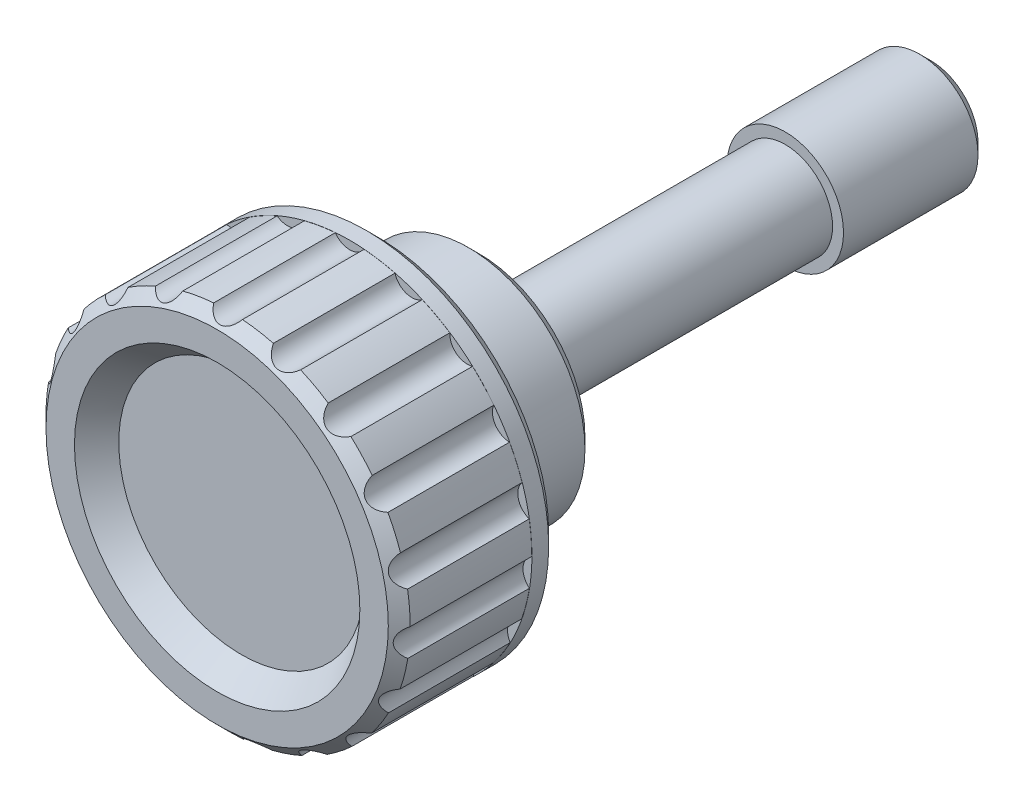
ISO-10303-21;
HEADER;
FILE_DESCRIPTION(('STEP AP214'),'2;1');
FILE_NAME('part.step','',(''),(''),'','','');
FILE_SCHEMA(('AUTOMOTIVE_DESIGN { 1 0 10303 214 1 1 1 1 }'));
ENDSEC;
DATA;
#1=APPLICATION_CONTEXT('core data for automotive mechanical design processes');
#2=APPLICATION_PROTOCOL_DEFINITION('international standard','automotive_design',2000,#1);
#3=PRODUCT_CONTEXT('',#1,'mechanical');
#4=PRODUCT('Part','Part','',(#3));
#5=PRODUCT_RELATED_PRODUCT_CATEGORY('part','',(#4));
#6=PRODUCT_DEFINITION_FORMATION('','',#4);
#7=PRODUCT_DEFINITION_CONTEXT('part definition',#1,'design');
#8=PRODUCT_DEFINITION('design','',#6,#7);
#9=PRODUCT_DEFINITION_SHAPE('','',#8);
#10=(LENGTH_UNIT() NAMED_UNIT(*) SI_UNIT(.MILLI.,.METRE.));
#11=(NAMED_UNIT(*) PLANE_ANGLE_UNIT() SI_UNIT($,.RADIAN.));
#12=(NAMED_UNIT(*) SI_UNIT($,.STERADIAN.) SOLID_ANGLE_UNIT());
#13=UNCERTAINTY_MEASURE_WITH_UNIT(LENGTH_MEASURE(1.E-05),#10,'distance_accuracy_value','');
#14=(GEOMETRIC_REPRESENTATION_CONTEXT(3) GLOBAL_UNCERTAINTY_ASSIGNED_CONTEXT((#13)) GLOBAL_UNIT_ASSIGNED_CONTEXT((#10,
#11,#12)) REPRESENTATION_CONTEXT('',''));
#15=CARTESIAN_POINT('',(0.,0.,0.));
#16=DIRECTION('',(0.,0.,1.));
#17=DIRECTION('',(1.,0.,0.));
#18=AXIS2_PLACEMENT_3D('',#15,#16,#17);
#19=CARTESIAN_POINT('',(0.,0.,0.));
#20=DIRECTION('',(0.,0.,1.));
#21=DIRECTION('',(1.,0.,0.));
#22=AXIS2_PLACEMENT_3D('',#19,#20,#21);
#23=PLANE('',#22);
#24=CARTESIAN_POINT('',(0.,0.,0.));
#25=DIRECTION('',(0.,0.,1.));
#26=DIRECTION('',(1.,0.,0.));
#27=AXIS2_PLACEMENT_3D('',#24,#25,#26);
#28=CIRCLE('',#27,5.33333333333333);
#29=CARTESIAN_POINT('',(5.33333333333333,0.,0.));
#30=VERTEX_POINT('',#29);
#31=EDGE_CURVE('E405',#30,#30,#28,.T.);
#32=ORIENTED_EDGE('',*,*,#31,.F.);
#33=EDGE_LOOP('',(#32));
#34=FACE_BOUND('',#33,.T.);
#35=CARTESIAN_POINT('',(0.,0.,0.));
#36=DIRECTION('',(0.,0.,1.));
#37=DIRECTION('',(1.,0.,0.));
#38=AXIS2_PLACEMENT_3D('',#35,#36,#37);
#39=CIRCLE('',#38,3.25);
#40=CARTESIAN_POINT('',(3.25,0.,0.));
#41=VERTEX_POINT('',#40);
#42=EDGE_CURVE('E462',#41,#41,#39,.T.);
#43=ORIENTED_EDGE('',*,*,#42,.T.);
#44=EDGE_LOOP('',(#43));
#45=FACE_BOUND('',#44,.T.);
#46=ADVANCED_FACE('F15',(#34,#45),#23,.F.);
#47=CARTESIAN_POINT('',(0.,0.,19.75));
#48=DIRECTION('',(0.,0.,1.));
#49=DIRECTION('',(1.,0.,0.));
#50=AXIS2_PLACEMENT_3D('',#47,#48,#49);
#51=CYLINDRICAL_SURFACE('',#50,5.33333333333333);
#52=CARTESIAN_POINT('',(0.,0.,1.));
#53=DIRECTION('',(0.,0.,1.));
#54=DIRECTION('',(1.,0.,0.));
#55=AXIS2_PLACEMENT_3D('',#52,#53,#54);
#56=CIRCLE('',#55,5.33333333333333);
#57=CARTESIAN_POINT('',(5.33333333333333,0.,1.00000000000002));
#58=VERTEX_POINT('',#57);
#59=EDGE_CURVE('E402',#58,#58,#56,.T.);
#60=ORIENTED_EDGE('',*,*,#59,.F.);
#61=EDGE_LOOP('',(#60));
#62=FACE_BOUND('',#61,.T.);
#63=ORIENTED_EDGE('',*,*,#31,.T.);
#64=EDGE_LOOP('',(#63));
#65=FACE_BOUND('',#64,.T.);
#66=ADVANCED_FACE('F450',(#62,#65),#51,.T.);
#67=CARTESIAN_POINT('',(0.,5.33333333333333,1.));
#68=DIRECTION('',(0.,0.,1.));
#69=DIRECTION('',(1.,0.,0.));
#70=AXIS2_PLACEMENT_3D('',#67,#68,#69);
#71=PLANE('',#70);
#72=CARTESIAN_POINT('',(0.,0.,1.));
#73=DIRECTION('',(0.,0.,1.));
#74=DIRECTION('',(1.,0.,0.));
#75=AXIS2_PLACEMENT_3D('',#72,#73,#74);
#76=CIRCLE('',#75,7.25);
#77=CARTESIAN_POINT('',(7.25,0.,1.00000000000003));
#78=VERTEX_POINT('',#77);
#79=EDGE_CURVE('E399',#78,#78,#76,.T.);
#80=ORIENTED_EDGE('',*,*,#79,.F.);
#81=EDGE_LOOP('',(#80));
#82=FACE_BOUND('',#81,.T.);
#83=ORIENTED_EDGE('',*,*,#59,.T.);
#84=EDGE_LOOP('',(#83));
#85=FACE_BOUND('',#84,.T.);
#86=ADVANCED_FACE('F456',(#82,#85),#71,.F.);
#87=CARTESIAN_POINT('',(0.,0.,1.));
#88=DIRECTION('',(0.,0.,1.));
#89=DIRECTION('',(1.,0.,0.));
#90=AXIS2_PLACEMENT_3D('',#87,#88,#89);
#91=CONICAL_SURFACE('',#90,7.25,0.785398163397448);
#92=CARTESIAN_POINT('',(0.,0.,1.75));
#93=DIRECTION('',(0.,0.,1.));
#94=DIRECTION('',(1.,0.,0.));
#95=AXIS2_PLACEMENT_3D('',#92,#93,#94);
#96=CIRCLE('',#95,8.);
#97=CARTESIAN_POINT('',(7.99999999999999,0.,1.75000000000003));
#98=VERTEX_POINT('',#97);
#99=EDGE_CURVE('E396',#98,#98,#96,.T.);
#100=ORIENTED_EDGE('',*,*,#99,.F.);
#101=EDGE_LOOP('',(#100));
#102=FACE_BOUND('',#101,.T.);
#103=ORIENTED_EDGE('',*,*,#79,.T.);
#104=EDGE_LOOP('',(#103));
#105=FACE_BOUND('',#104,.T.);
#106=ADVANCED_FACE('F1196',(#102,#105),#91,.T.);
#107=CARTESIAN_POINT('',(0.,0.,19.75));
#108=DIRECTION('',(0.,0.,1.));
#109=DIRECTION('',(1.,0.,0.));
#110=AXIS2_PLACEMENT_3D('',#107,#108,#109);
#111=CYLINDRICAL_SURFACE('',#110,8.);
#112=CARTESIAN_POINT('',(0.,0.,8.));
#113=DIRECTION('',(0.,0.,1.));
#114=DIRECTION('',(1.,0.,0.));
#115=AXIS2_PLACEMENT_3D('',#112,#113,#114);
#116=CIRCLE('',#115,8.);
#117=CARTESIAN_POINT('',(7.99999999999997,0.,8.00000000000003));
#118=VERTEX_POINT('',#117);
#119=EDGE_CURVE('E393',#118,#118,#116,.T.);
#120=ORIENTED_EDGE('',*,*,#119,.F.);
#121=EDGE_LOOP('',(#120));
#122=FACE_BOUND('',#121,.T.);
#123=ORIENTED_EDGE('',*,*,#99,.T.);
#124=EDGE_LOOP('',(#123));
#125=FACE_BOUND('',#124,.T.);
#126=ADVANCED_FACE('F1204',(#122,#125),#111,.T.);
#127=CARTESIAN_POINT('',(0.,8.,8.));
#128=DIRECTION('',(0.,0.,1.));
#129=DIRECTION('',(1.,0.,0.));
#130=AXIS2_PLACEMENT_3D('',#127,#128,#129);
#131=PLANE('',#130);
#132=CARTESIAN_POINT('',(0.,0.,8.));
#133=DIRECTION('',(0.,0.,1.));
#134=DIRECTION('',(1.,0.,0.));
#135=AXIS2_PLACEMENT_3D('',#132,#133,#134);
#136=CIRCLE('',#135,8.42105263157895);
#137=CARTESIAN_POINT('',(8.42105263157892,0.,8.00000000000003));
#138=VERTEX_POINT('',#137);
#139=EDGE_CURVE('E390',#138,#138,#136,.T.);
#140=ORIENTED_EDGE('',*,*,#139,.F.);
#141=EDGE_LOOP('',(#140));
#142=FACE_BOUND('',#141,.T.);
#143=ORIENTED_EDGE('',*,*,#119,.T.);
#144=EDGE_LOOP('',(#143));
#145=FACE_BOUND('',#144,.T.);
#146=ADVANCED_FACE('F1213',(#142,#145),#131,.F.);
#147=CARTESIAN_POINT('',(0.,0.,19.75));
#148=DIRECTION('',(0.,0.,1.));
#149=DIRECTION('',(1.,0.,0.));
#150=AXIS2_PLACEMENT_3D('',#147,#148,#149);
#151=CYLINDRICAL_SURFACE('',#150,8.42105263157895);
#152=CARTESIAN_POINT('',(0.,0.,13.5));
#153=DIRECTION('',(0.,0.,1.));
#154=DIRECTION('',(1.,0.,0.));
#155=AXIS2_PLACEMENT_3D('',#152,#153,#154);
#156=CIRCLE('',#155,8.42105263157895);
#157=CARTESIAN_POINT('',(8.4210526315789,0.,13.5));
#158=VERTEX_POINT('',#157);
#159=EDGE_CURVE('E387',#158,#158,#156,.T.);
#160=ORIENTED_EDGE('',*,*,#159,.F.);
#161=EDGE_LOOP('',(#160));
#162=FACE_BOUND('',#161,.T.);
#163=ORIENTED_EDGE('',*,*,#139,.T.);
#164=EDGE_LOOP('',(#163));
#165=FACE_BOUND('',#164,.T.);
#166=ADVANCED_FACE('F1222',(#162,#165),#151,.T.);
#167=CARTESIAN_POINT('',(0.,8.42105263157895,13.5));
#168=DIRECTION('',(0.,0.,1.));
#169=DIRECTION('',(1.,0.,0.));
#170=AXIS2_PLACEMENT_3D('',#167,#168,#169);
#171=PLANE('',#170);
#172=CARTESIAN_POINT('',(0.,0.,13.5));
#173=DIRECTION('',(0.,0.,1.));
#174=DIRECTION('',(1.,0.,0.));
#175=AXIS2_PLACEMENT_3D('',#172,#173,#174);
#176=CIRCLE('',#175,10.8695652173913);
#177=CARTESIAN_POINT('',(10.8695652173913,0.,13.5));
#178=VERTEX_POINT('',#177);
#179=EDGE_CURVE('E384',#178,#178,#176,.T.);
#180=ORIENTED_EDGE('',*,*,#179,.F.);
#181=EDGE_LOOP('',(#180));
#182=FACE_BOUND('',#181,.T.);
#183=ORIENTED_EDGE('',*,*,#159,.T.);
#184=EDGE_LOOP('',(#183));
#185=FACE_BOUND('',#184,.T.);
#186=ADVANCED_FACE('F1231',(#182,#185),#171,.F.);
#187=CARTESIAN_POINT('',(0.,0.,19.75));
#188=DIRECTION('',(0.,0.,1.));
#189=DIRECTION('',(1.,0.,0.));
#190=AXIS2_PLACEMENT_3D('',#187,#188,#189);
#191=CYLINDRICAL_SURFACE('',#190,10.8695652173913);
#192=CARTESIAN_POINT('',(0.,0.,8.));
#193=DIRECTION('',(0.,0.,1.));
#194=DIRECTION('',(1.,0.,0.));
#195=AXIS2_PLACEMENT_3D('',#192,#193,#194);
#196=CIRCLE('',#195,10.8695652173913);
#197=CARTESIAN_POINT('',(10.8695652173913,0.,8.00000000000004));
#198=VERTEX_POINT('',#197);
#199=EDGE_CURVE('E280',#198,#198,#196,.T.);
#200=ORIENTED_EDGE('',*,*,#199,.F.);
#201=EDGE_LOOP('',(#200));
#202=FACE_BOUND('',#201,.T.);
#203=ORIENTED_EDGE('',*,*,#179,.T.);
#204=EDGE_LOOP('',(#203));
#205=FACE_BOUND('',#204,.T.);
#206=ADVANCED_FACE('F897',(#202,#205),#191,.F.);
#207=CARTESIAN_POINT('',(0.,10.8695652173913,9.9));
#208=DIRECTION('',(0.,0.,1.));
#209=DIRECTION('',(1.,0.,0.));
#210=AXIS2_PLACEMENT_3D('',#207,#208,#209);
#211=PLANE('',#210);
#212=CARTESIAN_POINT('',(0.,0.,9.9));
#213=DIRECTION('',(0.,0.,1.));
#214=DIRECTION('',(1.,0.,0.));
#215=AXIS2_PLACEMENT_3D('',#212,#213,#214);
#216=CIRCLE('',#215,12.51);
#217=CARTESIAN_POINT('',(12.51,0.,9.90000000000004));
#218=VERTEX_POINT('',#217);
#219=EDGE_CURVE('E484',#218,#218,#216,.T.);
#220=ORIENTED_EDGE('',*,*,#219,.T.);
#221=EDGE_LOOP('',(#220));
#222=FACE_BOUND('',#221,.T.);
#223=CARTESIAN_POINT('',(-12.7379194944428,3.2256793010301,9.9));
#224=DIRECTION('',(0.,0.,1.));
#225=DIRECTION('',(1.,0.,0.));
#226=AXIS2_PLACEMENT_3D('',#223,#224,#225);
#227=CIRCLE('',#226,1.2);
#228=CARTESIAN_POINT('',(-12.3223485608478,2.09993474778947,9.9));
#229=VERTEX_POINT('',#228);
#230=CARTESIAN_POINT('',(-11.836640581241,4.01795218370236,9.9));
#231=VERTEX_POINT('',#230);
#232=EDGE_CURVE('E274',#229,#231,#227,.T.);
#233=ORIENTED_EDGE('',*,*,#232,.T.);
#234=CARTESIAN_POINT('',(-2.68753334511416E-13,0.,9.9));
#235=DIRECTION('',(0.,0.,1.));
#236=DIRECTION('',(1.,0.,0.));
#237=AXIS2_PLACEMENT_3D('',#234,#235,#236);
#238=CIRCLE('',#237,12.4999999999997);
#239=CARTESIAN_POINT('',(-10.9728420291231,5.98721452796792,9.9));
#240=VERTEX_POINT('',#239);
#241=EDGE_CURVE('E373',#240,#231,#238,.T.);
#242=ORIENTED_EDGE('',*,*,#241,.F.);
#243=CARTESIAN_POINT('',(-11.0003675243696,7.18689879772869,9.9));
#244=DIRECTION('',(0.,0.,1.));
#245=DIRECTION('',(1.,0.,0.));
#246=AXIS2_PLACEMENT_3D('',#243,#244,#245);
#247=CIRCLE('',#246,1.2);
#248=CARTESIAN_POINT('',(-9.89067180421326,7.64359936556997,9.9));
#249=VERTEX_POINT('',#248);
#250=EDGE_CURVE('E370',#240,#249,#247,.T.);
#251=ORIENTED_EDGE('',*,*,#250,.T.);
#252=CARTESIAN_POINT('',(-3.5895895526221E-13,2.77555756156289E-13,9.9));
#253=DIRECTION('',(0.,0.,1.));
#254=DIRECTION('',(1.,0.,0.));
#255=AXIS2_PLACEMENT_3D('',#252,#253,#254);
#256=CIRCLE('',#255,12.4999999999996);
#257=CARTESIAN_POINT('',(-8.43425780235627,9.22568671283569,9.9));
#258=VERTEX_POINT('',#257);
#259=EDGE_CURVE('E368',#258,#249,#256,.T.);
#260=ORIENTED_EDGE('',*,*,#259,.F.);
#261=CARTESIAN_POINT('',(-8.07075504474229,10.3693062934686,9.9));
#262=DIRECTION('',(0.,0.,1.));
#263=DIRECTION('',(1.,0.,0.));
#264=AXIS2_PLACEMENT_3D('',#261,#262,#263);
#265=CIRCLE('',#264,1.2);
#266=CARTESIAN_POINT('',(-6.87289526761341,10.4409439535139,9.9));
#267=VERTEX_POINT('',#266);
#268=EDGE_CURVE('E365',#258,#267,#265,.T.);
#269=ORIENTED_EDGE('',*,*,#268,.T.);
#270=CARTESIAN_POINT('',(1.89213663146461E-13,-4.28476698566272E-13,9.9));
#271=DIRECTION('',(0.,0.,1.));
#272=DIRECTION('',(1.,0.,0.));
#273=AXIS2_PLACEMENT_3D('',#270,#271,#272);
#274=CIRCLE('',#273,12.5000000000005);
#275=CARTESIAN_POINT('',(-4.98169087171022,11.464412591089,9.9));
#276=VERTEX_POINT('',#275);
#277=EDGE_CURVE('E363',#276,#267,#274,.T.);
#278=ORIENTED_EDGE('',*,*,#277,.F.);
#279=CARTESIAN_POINT('',(-4.26655102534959,12.4280385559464,9.9));
#280=DIRECTION('',(0.,0.,1.));
#281=DIRECTION('',(1.,0.,0.));
#282=AXIS2_PLACEMENT_3D('',#279,#280,#281);
#283=CIRCLE('',#282,1.2);
#284=CARTESIAN_POINT('',(-3.11033388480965,12.1068502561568,9.9));
#285=VERTEX_POINT('',#284);
#286=EDGE_CURVE('E360',#276,#285,#283,.T.);
#287=ORIENTED_EDGE('',*,*,#286,.T.);
#288=CARTESIAN_POINT('',(0.,-6.66133814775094E-13,9.9));
#289=DIRECTION('',(0.,0.,1.));
#290=DIRECTION('',(1.,0.,0.));
#291=AXIS2_PLACEMENT_3D('',#288,#289,#290);
#292=CIRCLE('',#291,12.5000000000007);
#293=CARTESIAN_POINT('',(-0.989280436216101,12.4607914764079,9.9));
#294=VERTEX_POINT('',#293);
#295=EDGE_CURVE('E358',#294,#285,#292,.T.);
#296=ORIENTED_EDGE('',*,*,#295,.F.);
#297=CARTESIAN_POINT('',(0.,13.14,9.9));
#298=DIRECTION('',(0.,0.,1.));
#299=DIRECTION('',(1.,0.,0.));
#300=AXIS2_PLACEMENT_3D('',#297,#298,#299);
#301=CIRCLE('',#300,1.2);
#302=CARTESIAN_POINT('',(0.989280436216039,12.4607914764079,9.9));
#303=VERTEX_POINT('',#302);
#304=EDGE_CURVE('E356',#294,#303,#301,.T.);
#305=ORIENTED_EDGE('',*,*,#304,.T.);
#306=CARTESIAN_POINT('',(0.,0.,9.9));
#307=DIRECTION('',(0.,0.,1.));
#308=DIRECTION('',(1.,0.,0.));
#309=AXIS2_PLACEMENT_3D('',#306,#307,#308);
#310=CIRCLE('',#309,12.5);
#311=CARTESIAN_POINT('',(3.11033388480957,12.1068502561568,9.9));
#312=VERTEX_POINT('',#311);
#313=EDGE_CURVE('E353',#312,#303,#310,.T.);
#314=ORIENTED_EDGE('',*,*,#313,.F.);
#315=CARTESIAN_POINT('',(4.26655102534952,12.4280385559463,9.9));
#316=DIRECTION('',(0.,0.,1.));
#317=DIRECTION('',(1.,0.,0.));
#318=AXIS2_PLACEMENT_3D('',#315,#316,#317);
#319=CIRCLE('',#318,1.2);
#320=CARTESIAN_POINT('',(4.98169087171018,11.464412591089,9.9));
#321=VERTEX_POINT('',#320);
#322=EDGE_CURVE('E350',#312,#321,#319,.T.);
#323=ORIENTED_EDGE('',*,*,#322,.T.);
#324=CARTESIAN_POINT('',(-1.31710179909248E-13,-1.82145964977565E-13,9.9));
#325=DIRECTION('',(0.,0.,1.));
#326=DIRECTION('',(1.,0.,0.));
#327=AXIS2_PLACEMENT_3D('',#324,#325,#326);
#328=CIRCLE('',#327,12.5000000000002);
#329=CARTESIAN_POINT('',(6.87289526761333,10.4409439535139,9.9));
#330=VERTEX_POINT('',#329);
#331=EDGE_CURVE('E348',#330,#321,#328,.T.);
#332=ORIENTED_EDGE('',*,*,#331,.F.);
#333=CARTESIAN_POINT('',(8.07075504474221,10.3693062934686,9.9));
#334=DIRECTION('',(0.,0.,1.));
#335=DIRECTION('',(1.,0.,0.));
#336=AXIS2_PLACEMENT_3D('',#333,#334,#335);
#337=CIRCLE('',#336,1.2);
#338=CARTESIAN_POINT('',(8.43425780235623,9.22568671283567,9.9));
#339=VERTEX_POINT('',#338);
#340=EDGE_CURVE('E345',#330,#339,#337,.T.);
#341=ORIENTED_EDGE('',*,*,#340,.T.);
#342=CARTESIAN_POINT('',(1.18090000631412E-13,1.35308431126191E-13,9.9));
#343=DIRECTION('',(0.,0.,1.));
#344=DIRECTION('',(1.,0.,0.));
#345=AXIS2_PLACEMENT_3D('',#342,#343,#344);
#346=CIRCLE('',#345,12.4999999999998);
#347=CARTESIAN_POINT('',(9.89067180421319,7.64359936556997,9.9));
#348=VERTEX_POINT('',#347);
#349=EDGE_CURVE('E343',#348,#339,#346,.T.);
#350=ORIENTED_EDGE('',*,*,#349,.F.);
#351=CARTESIAN_POINT('',(11.0003675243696,7.18689879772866,9.9));
#352=DIRECTION('',(0.,0.,1.));
#353=DIRECTION('',(1.,0.,0.));
#354=AXIS2_PLACEMENT_3D('',#351,#352,#353);
#355=CIRCLE('',#354,1.2);
#356=CARTESIAN_POINT('',(10.9728420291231,5.98721452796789,9.9));
#357=VERTEX_POINT('',#356);
#358=EDGE_CURVE('E340',#348,#357,#355,.T.);
#359=ORIENTED_EDGE('',*,*,#358,.T.);
#360=CARTESIAN_POINT('',(-2.70488057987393E-13,0.,9.9));
#361=DIRECTION('',(0.,0.,1.));
#362=DIRECTION('',(1.,0.,0.));
#363=AXIS2_PLACEMENT_3D('',#360,#361,#362);
#364=CIRCLE('',#363,12.5000000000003);
#365=CARTESIAN_POINT('',(11.836640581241,4.01795218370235,9.9));
#366=VERTEX_POINT('',#365);
#367=EDGE_CURVE('E338',#366,#357,#364,.T.);
#368=ORIENTED_EDGE('',*,*,#367,.F.);
#369=CARTESIAN_POINT('',(12.7379194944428,3.2256793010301,9.9));
#370=DIRECTION('',(0.,0.,1.));
#371=DIRECTION('',(1.,0.,0.));
#372=AXIS2_PLACEMENT_3D('',#369,#370,#371);
#373=CIRCLE('',#372,1.2);
#374=CARTESIAN_POINT('',(12.3223485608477,2.09993474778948,9.9));
#375=VERTEX_POINT('',#374);
#376=EDGE_CURVE('E335',#366,#375,#373,.T.);
#377=ORIENTED_EDGE('',*,*,#376,.T.);
#378=CARTESIAN_POINT('',(-2.44467205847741E-13,0.,9.9));
#379=DIRECTION('',(0.,0.,1.));
#380=DIRECTION('',(1.,0.,0.));
#381=AXIS2_PLACEMENT_3D('',#378,#379,#380);
#382=CIRCLE('',#381,12.5000000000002);
#383=CARTESIAN_POINT('',(12.4999256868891,-0.0431024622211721,9.9));
#384=VERTEX_POINT('',#383);
#385=EDGE_CURVE('E333',#384,#375,#382,.T.);
#386=ORIENTED_EDGE('',*,*,#385,.F.);
#387=CARTESIAN_POINT('',(13.0951202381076,-1.08509259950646,9.9));
#388=DIRECTION('',(0.,0.,1.));
#389=DIRECTION('',(1.,0.,0.));
#390=AXIS2_PLACEMENT_3D('',#387,#388,#389);
#391=CIRCLE('',#390,1.2);
#392=CARTESIAN_POINT('',(12.3365374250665,-2.01490554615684,9.9));
#393=VERTEX_POINT('',#392);
#394=EDGE_CURVE('E330',#384,#393,#391,.T.);
#395=ORIENTED_EDGE('',*,*,#394,.T.);
#396=CARTESIAN_POINT('',(-1.76812990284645E-13,0.,9.9));
#397=DIRECTION('',(0.,0.,1.));
#398=DIRECTION('',(1.,0.,0.));
#399=AXIS2_PLACEMENT_3D('',#396,#397,#398);
#400=CIRCLE('',#399,12.5000000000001);
#401=CARTESIAN_POINT('',(11.8086498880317,-4.09948628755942,9.9));
#402=VERTEX_POINT('',#401);
#403=EDGE_CURVE('E328',#402,#393,#400,.T.);
#404=ORIENTED_EDGE('',*,*,#403,.F.);
#405=CARTESIAN_POINT('',(12.0332615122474,-5.27827787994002,9.9));
#406=DIRECTION('',(0.,0.,1.));
#407=DIRECTION('',(1.,0.,0.));
#408=AXIS2_PLACEMENT_3D('',#405,#406,#407);
#409=CIRCLE('',#408,1.2);
#410=CARTESIAN_POINT('',(11.0138710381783,-5.91139955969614,9.9));
#411=VERTEX_POINT('',#410);
#412=EDGE_CURVE('E325',#402,#411,#409,.T.);
#413=ORIENTED_EDGE('',*,*,#412,.T.);
#414=CARTESIAN_POINT('',(1.61458087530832E-13,-1.36175792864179E-13,9.9));
#415=DIRECTION('',(0.,0.,1.));
#416=DIRECTION('',(1.,0.,0.));
#417=AXIS2_PLACEMENT_3D('',#414,#415,#416);
#418=CIRCLE('',#417,12.4999999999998);
#419=CARTESIAN_POINT('',(9.83772364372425,-7.71162716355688,9.9));
#420=VERTEX_POINT('',#419);
#421=EDGE_CURVE('E323',#420,#411,#418,.T.);
#422=ORIENTED_EDGE('',*,*,#421,.F.);
#423=CARTESIAN_POINT('',(9.66741218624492,-8.89947985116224,9.9));
#424=DIRECTION('',(0.,0.,1.));
#425=DIRECTION('',(1.,0.,0.));
#426=AXIS2_PLACEMENT_3D('',#423,#424,#425);
#427=CIRCLE('',#426,1.2);
#428=CARTESIAN_POINT('',(8.4976808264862,-9.16730170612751,9.9));
#429=VERTEX_POINT('',#428);
#430=EDGE_CURVE('E320',#420,#429,#427,.T.);
#431=ORIENTED_EDGE('',*,*,#430,.T.);
#432=CARTESIAN_POINT('',(0.,-1.78676518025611E-13,9.9));
#433=DIRECTION('',(0.,0.,1.));
#434=DIRECTION('',(1.,0.,0.));
#435=AXIS2_PLACEMENT_3D('',#432,#433,#434);
#436=CIRCLE('',#435,12.4999999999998);
#437=CARTESIAN_POINT('',(6.80072739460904,-10.4880935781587,9.9));
#438=VERTEX_POINT('',#437);
#439=EDGE_CURVE('E318',#438,#429,#436,.T.);
#440=ORIENTED_EDGE('',*,*,#439,.F.);
#441=CARTESIAN_POINT('',(6.25394874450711,-11.5562850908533,9.9));
#442=DIRECTION('',(0.,0.,1.));
#443=DIRECTION('',(1.,0.,0.));
#444=AXIS2_PLACEMENT_3D('',#441,#442,#443);
#445=CIRCLE('',#444,1.2);
#446=CARTESIAN_POINT('',(5.06063504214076,-11.4297844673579,9.9));
#447=VERTEX_POINT('',#446);
#448=EDGE_CURVE('E315',#438,#447,#445,.T.);
#449=ORIENTED_EDGE('',*,*,#448,.T.);
#450=CARTESIAN_POINT('',(-1.56429989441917E-13,3.66026653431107E-13,9.9));
#451=DIRECTION('',(0.,0.,1.));
#452=DIRECTION('',(1.,0.,0.));
#453=AXIS2_PLACEMENT_3D('',#450,#451,#452);
#454=CIRCLE('',#453,12.5000000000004);
#455=CARTESIAN_POINT('',(3.02676680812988,-12.1280123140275,9.9));
#456=VERTEX_POINT('',#455);
#457=EDGE_CURVE('E313',#456,#447,#454,.T.);
#458=ORIENTED_EDGE('',*,*,#457,.F.);
#459=CARTESIAN_POINT('',(2.16277291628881,-12.9607875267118,9.9));
#460=DIRECTION('',(0.,0.,1.));
#461=DIRECTION('',(1.,0.,0.));
#462=AXIS2_PLACEMENT_3D('',#459,#460,#461);
#463=CIRCLE('',#462,1.2);
#464=CARTESIAN_POINT('',(1.07519092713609,-12.453672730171,9.9));
#465=VERTEX_POINT('',#464);
#466=EDGE_CURVE('E310',#456,#465,#463,.T.);
#467=ORIENTED_EDGE('',*,*,#466,.T.);
#468=CARTESIAN_POINT('',(0.,-4.82253126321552E-13,9.9));
#469=DIRECTION('',(0.,0.,1.));
#470=DIRECTION('',(1.,0.,0.));
#471=AXIS2_PLACEMENT_3D('',#468,#469,#470);
#472=CIRCLE('',#471,12.4999999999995);
#473=CARTESIAN_POINT('',(-1.07519092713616,-12.453672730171,9.9));
#474=VERTEX_POINT('',#473);
#475=EDGE_CURVE('E308',#474,#465,#472,.T.);
#476=ORIENTED_EDGE('',*,*,#475,.F.);
#477=CARTESIAN_POINT('',(-2.16277291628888,-12.9607875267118,9.9));
#478=DIRECTION('',(0.,0.,1.));
#479=DIRECTION('',(1.,0.,0.));
#480=AXIS2_PLACEMENT_3D('',#477,#478,#479);
#481=CIRCLE('',#480,1.2);
#482=CARTESIAN_POINT('',(-3.02676680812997,-12.1280123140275,9.9));
#483=VERTEX_POINT('',#482);
#484=EDGE_CURVE('E305',#474,#483,#481,.T.);
#485=ORIENTED_EDGE('',*,*,#484,.T.);
#486=CARTESIAN_POINT('',(-1.04821966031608E-13,-2.4980018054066E-13,9.9));
#487=DIRECTION('',(0.,0.,1.));
#488=DIRECTION('',(1.,0.,0.));
#489=AXIS2_PLACEMENT_3D('',#486,#487,#488);
#490=CIRCLE('',#489,12.4999999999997);
#491=CARTESIAN_POINT('',(-5.06063504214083,-11.4297844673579,9.9));
#492=VERTEX_POINT('',#491);
#493=EDGE_CURVE('E303',#492,#483,#490,.T.);
#494=ORIENTED_EDGE('',*,*,#493,.F.);
#495=CARTESIAN_POINT('',(-6.25394874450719,-11.5562850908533,9.9));
#496=DIRECTION('',(0.,0.,1.));
#497=DIRECTION('',(1.,0.,0.));
#498=AXIS2_PLACEMENT_3D('',#495,#496,#497);
#499=CIRCLE('',#498,1.2);
#500=CARTESIAN_POINT('',(-6.80072739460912,-10.4880935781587,9.9));
#501=VERTEX_POINT('',#500);
#502=EDGE_CURVE('E300',#492,#501,#499,.T.);
#503=ORIENTED_EDGE('',*,*,#502,.T.);
#504=CARTESIAN_POINT('',(-1.66404649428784E-13,-1.40512601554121E-13,9.9));
#505=DIRECTION('',(0.,0.,1.));
#506=DIRECTION('',(1.,0.,0.));
#507=AXIS2_PLACEMENT_3D('',#504,#505,#506);
#508=CIRCLE('',#507,12.4999999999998);
#509=CARTESIAN_POINT('',(-8.49768082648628,-9.1673017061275,9.9));
#510=VERTEX_POINT('',#509);
#511=EDGE_CURVE('E298',#510,#501,#508,.T.);
#512=ORIENTED_EDGE('',*,*,#511,.F.);
#513=CARTESIAN_POINT('',(-9.66741218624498,-8.89947985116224,9.9));
#514=DIRECTION('',(0.,0.,1.));
#515=DIRECTION('',(1.,0.,0.));
#516=AXIS2_PLACEMENT_3D('',#513,#514,#515);
#517=CIRCLE('',#516,1.2);
#518=CARTESIAN_POINT('',(-9.83772364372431,-7.71162716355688,9.9));
#519=VERTEX_POINT('',#518);
#520=EDGE_CURVE('E295',#510,#519,#517,.T.);
#521=ORIENTED_EDGE('',*,*,#520,.T.);
#522=CARTESIAN_POINT('',(2.86358177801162E-13,2.12503625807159E-13,9.9));
#523=DIRECTION('',(0.,0.,1.));
#524=DIRECTION('',(1.,0.,0.));
#525=AXIS2_PLACEMENT_3D('',#522,#523,#524);
#526=CIRCLE('',#525,12.5000000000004);
#527=CARTESIAN_POINT('',(-11.0138710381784,-5.91139955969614,9.9));
#528=VERTEX_POINT('',#527);
#529=EDGE_CURVE('E293',#528,#519,#526,.T.);
#530=ORIENTED_EDGE('',*,*,#529,.F.);
#531=CARTESIAN_POINT('',(-12.0332615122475,-5.27827787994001,9.9));
#532=DIRECTION('',(0.,0.,1.));
#533=DIRECTION('',(1.,0.,0.));
#534=AXIS2_PLACEMENT_3D('',#531,#532,#533);
#535=CIRCLE('',#534,1.2);
#536=CARTESIAN_POINT('',(-11.8086498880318,-4.09948628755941,9.9));
#537=VERTEX_POINT('',#536);
#538=EDGE_CURVE('E287',#528,#537,#535,.T.);
#539=ORIENTED_EDGE('',*,*,#538,.T.);
#540=CARTESIAN_POINT('',(-4.49164576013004E-13,0.,9.9));
#541=DIRECTION('',(0.,0.,1.));
#542=DIRECTION('',(1.,0.,0.));
#543=AXIS2_PLACEMENT_3D('',#540,#541,#542);
#544=CIRCLE('',#543,12.4999999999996);
#545=CARTESIAN_POINT('',(-12.3365374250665,-2.01490554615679,9.9));
#546=VERTEX_POINT('',#545);
#547=EDGE_CURVE('E285',#546,#537,#544,.T.);
#548=ORIENTED_EDGE('',*,*,#547,.F.);
#549=CARTESIAN_POINT('',(-13.0951202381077,-1.08509259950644,9.9));
#550=DIRECTION('',(0.,0.,1.));
#551=DIRECTION('',(1.,0.,0.));
#552=AXIS2_PLACEMENT_3D('',#549,#550,#551);
#553=CIRCLE('',#552,1.2);
#554=CARTESIAN_POINT('',(-12.4999256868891,-0.0431024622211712,9.9));
#555=VERTEX_POINT('',#554);
#556=EDGE_CURVE('E277',#546,#555,#553,.T.);
#557=ORIENTED_EDGE('',*,*,#556,.T.);
#558=CARTESIAN_POINT('',(0.,0.,9.9));
#559=DIRECTION('',(0.,0.,1.));
#560=DIRECTION('',(1.,0.,0.));
#561=AXIS2_PLACEMENT_3D('',#558,#559,#560);
#562=CIRCLE('',#561,12.5);
#563=EDGE_CURVE('E265',#229,#555,#562,.T.);
#564=ORIENTED_EDGE('',*,*,#563,.F.);
#565=EDGE_LOOP('',(#233,#242,#251,#260,#269,#278,#287,#296,#305,#314,#323,#332,#341,#350,#359,
#368,#377,#386,#395,#404,#413,#422,#431,#440,#449,#458,#467,#476,#485,#494,#503,#512,#521,#530,
#539,#548,#557,#564));
#566=FACE_BOUND('',#565,.T.);
#567=ADVANCED_FACE('F283',(#222,#566),#211,.T.);
#568=CARTESIAN_POINT('',(0.,11.76,8.));
#569=DIRECTION('',(0.,0.,-1.));
#570=DIRECTION('',(-1.,0.,0.));
#571=AXIS2_PLACEMENT_3D('',#568,#569,#570);
#572=PLANE('',#571);
#573=ORIENTED_EDGE('',*,*,#199,.T.);
#574=EDGE_LOOP('',(#573));
#575=FACE_BOUND('',#574,.T.);
#576=CARTESIAN_POINT('',(0.,0.,8.));
#577=DIRECTION('',(0.,0.,1.));
#578=DIRECTION('',(1.,0.,0.));
#579=AXIS2_PLACEMENT_3D('',#576,#577,#578);
#580=CIRCLE('',#579,11.76);
#581=CARTESIAN_POINT('',(11.76,0.,8.00000000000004));
#582=VERTEX_POINT('',#581);
#583=EDGE_CURVE('E478',#582,#582,#580,.T.);
#584=ORIENTED_EDGE('',*,*,#583,.F.);
#585=EDGE_LOOP('',(#584));
#586=FACE_BOUND('',#585,.T.);
#587=ADVANCED_FACE('F890',(#575,#586),#572,.T.);
#588=CARTESIAN_POINT('',(0.,0.,19.));
#589=DIRECTION('',(0.,0.,1.));
#590=DIRECTION('',(1.,0.,0.));
#591=AXIS2_PLACEMENT_3D('',#588,#589,#590);
#592=CYLINDRICAL_SURFACE('',#591,12.51);
#593=CARTESIAN_POINT('',(0.,0.,8.75));
#594=DIRECTION('',(0.,0.,1.));
#595=DIRECTION('',(1.,0.,0.));
#596=AXIS2_PLACEMENT_3D('',#593,#594,#595);
#597=CIRCLE('',#596,12.51);
#598=CARTESIAN_POINT('',(12.51,0.,8.75000000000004));
#599=VERTEX_POINT('',#598);
#600=EDGE_CURVE('E481',#599,#599,#597,.T.);
#601=ORIENTED_EDGE('',*,*,#600,.T.);
#602=EDGE_LOOP('',(#601));
#603=FACE_BOUND('',#602,.T.);
#604=ORIENTED_EDGE('',*,*,#219,.F.);
#605=EDGE_LOOP('',(#604));
#606=FACE_BOUND('',#605,.T.);
#607=ADVANCED_FACE('F893',(#603,#606),#592,.T.);
#608=CARTESIAN_POINT('',(0.,0.,8.75));
#609=DIRECTION('',(0.,0.,1.));
#610=DIRECTION('',(1.,0.,0.));
#611=AXIS2_PLACEMENT_3D('',#608,#609,#610);
#612=CONICAL_SURFACE('',#611,12.51,0.785398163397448);
#613=ORIENTED_EDGE('',*,*,#583,.T.);
#614=EDGE_LOOP('',(#613));
#615=FACE_BOUND('',#614,.T.);
#616=ORIENTED_EDGE('',*,*,#600,.F.);
#617=EDGE_LOOP('',(#616));
#618=FACE_BOUND('',#617,.T.);
#619=ADVANCED_FACE('F434',(#615,#618),#612,.T.);
#620=CARTESIAN_POINT('',(0.,8.42105263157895,17.3333333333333));
#621=DIRECTION('',(0.,0.,-1.));
#622=DIRECTION('',(-1.,0.,0.));
#623=AXIS2_PLACEMENT_3D('',#620,#621,#622);
#624=PLANE('',#623);
#625=CARTESIAN_POINT('',(0.,0.,17.3333333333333));
#626=DIRECTION('',(0.,0.,1.));
#627=DIRECTION('',(1.,0.,0.));
#628=AXIS2_PLACEMENT_3D('',#625,#626,#627);
#629=CIRCLE('',#628,8.42105263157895);
#630=CARTESIAN_POINT('',(8.42105263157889,0.,17.3333333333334));
#631=VERTEX_POINT('',#630);
#632=EDGE_CURVE('E273',#631,#631,#629,.T.);
#633=ORIENTED_EDGE('',*,*,#632,.T.);
#634=EDGE_LOOP('',(#633));
#635=FACE_BOUND('',#634,.T.);
#636=ADVANCED_FACE('F430',(#635),#624,.F.);
#637=CARTESIAN_POINT('',(0.,0.,19.));
#638=DIRECTION('',(0.,0.,1.));
#639=DIRECTION('',(1.,0.,0.));
#640=AXIS2_PLACEMENT_3D('',#637,#638,#639);
#641=CONICAL_SURFACE('',#640,9.796875,0.690093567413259);
#642=ORIENTED_EDGE('',*,*,#632,.F.);
#643=EDGE_LOOP('',(#642));
#644=FACE_BOUND('',#643,.T.);
#645=CARTESIAN_POINT('',(0.,0.,19.));
#646=DIRECTION('',(0.,0.,1.));
#647=DIRECTION('',(1.,0.,0.));
#648=AXIS2_PLACEMENT_3D('',#645,#646,#647);
#649=CIRCLE('',#648,9.796875);
#650=CARTESIAN_POINT('',(9.79687499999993,0.,19.));
#651=VERTEX_POINT('',#650);
#652=EDGE_CURVE('E378',#651,#651,#649,.T.);
#653=ORIENTED_EDGE('',*,*,#652,.T.);
#654=EDGE_LOOP('',(#653));
#655=FACE_BOUND('',#654,.T.);
#656=ADVANCED_FACE('F433',(#644,#655),#641,.F.);
#657=CARTESIAN_POINT('',(0.,11.75,19.));
#658=DIRECTION('',(0.,0.,-1.));
#659=DIRECTION('',(-1.,0.,0.));
#660=AXIS2_PLACEMENT_3D('',#657,#658,#659);
#661=PLANE('',#660);
#662=ORIENTED_EDGE('',*,*,#652,.F.);
#663=EDGE_LOOP('',(#662));
#664=FACE_BOUND('',#663,.T.);
#665=CARTESIAN_POINT('',(0.,0.,19.));
#666=DIRECTION('',(0.,0.,1.));
#667=DIRECTION('',(1.,0.,0.));
#668=AXIS2_PLACEMENT_3D('',#665,#666,#667);
#669=CIRCLE('',#668,11.75);
#670=CARTESIAN_POINT('',(11.7499999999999,0.,19.));
#671=VERTEX_POINT('',#670);
#672=EDGE_CURVE('E381',#671,#671,#669,.T.);
#673=ORIENTED_EDGE('',*,*,#672,.T.);
#674=EDGE_LOOP('',(#673));
#675=FACE_BOUND('',#674,.T.);
#676=ADVANCED_FACE('F437',(#664,#675),#661,.F.);
#677=CARTESIAN_POINT('',(0.,0.,17.25));
#678=DIRECTION('',(0.,0.,-1.));
#679=DIRECTION('',(-1.,0.,0.));
#680=AXIS2_PLACEMENT_3D('',#677,#678,#679);
#681=CONICAL_SURFACE('',#680,13.5,0.785398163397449);
#682=ORIENTED_EDGE('',*,*,#672,.F.);
#683=EDGE_LOOP('',(#682));
#684=FACE_BOUND('',#683,.T.);
#685=CARTESIAN_POINT('',(0.,0.,18.2500000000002));
#686=DIRECTION('',(0.,0.,-1.));
#687=DIRECTION('',(-1.,0.,0.));
#688=AXIS2_PLACEMENT_3D('',#685,#686,#687);
#689=CIRCLE('',#688,12.4999999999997);
#690=CARTESIAN_POINT('',(-11.8366405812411,4.01795218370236,18.25));
#691=VERTEX_POINT('',#690);
#692=CARTESIAN_POINT('',(-10.9728420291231,5.98721452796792,18.25));
#693=VERTEX_POINT('',#692);
#694=EDGE_CURVE('E28',#691,#693,#689,.T.);
#695=ORIENTED_EDGE('',*,*,#694,.F.);
#696=CARTESIAN_POINT('',(-11.8368164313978,4.01815218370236,18.2497691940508));
#697=CARTESIAN_POINT('',(-11.8115610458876,3.98941880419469,18.2829174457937));
#698=CARTESIAN_POINT('',(-11.787338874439,3.95912008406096,18.3155526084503));
#699=CARTESIAN_POINT('',(-11.741261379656,3.89518591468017,18.3795052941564));
#700=CARTESIAN_POINT('',(-11.7194159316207,3.86153757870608,18.4108170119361));
#701=CARTESIAN_POINT('',(-11.6783201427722,3.79044108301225,18.4719769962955));
#702=CARTESIAN_POINT('',(-11.6591096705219,3.75294698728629,18.5017991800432));
#703=CARTESIAN_POINT('',(-11.6242255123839,3.67459144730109,18.5588468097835));
#704=CARTESIAN_POINT('',(-11.6085454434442,3.63373626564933,18.5860768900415));
#705=CARTESIAN_POINT('',(-11.5801039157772,3.54479477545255,18.6395589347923));
#706=CARTESIAN_POINT('',(-11.5677363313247,3.49638870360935,18.6654980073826));
#707=CARTESIAN_POINT('',(-11.5490046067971,3.39616877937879,18.712083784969));
#708=CARTESIAN_POINT('',(-11.5426172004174,3.3443689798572,18.7327507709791));
#709=CARTESIAN_POINT('',(-11.5367723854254,3.23749078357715,18.7676846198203));
#710=CARTESIAN_POINT('',(-11.5374009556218,3.18237996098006,18.7818698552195));
#711=CARTESIAN_POINT('',(-11.5465936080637,3.07129133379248,18.8020433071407));
#712=CARTESIAN_POINT('',(-11.5551515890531,3.01531422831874,18.8080378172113));
#713=CARTESIAN_POINT('',(-11.5783548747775,2.91302953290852,18.8109170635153));
#714=CARTESIAN_POINT('',(-11.5919249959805,2.8665065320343,18.8090074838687));
#715=CARTESIAN_POINT('',(-11.6243048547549,2.77604644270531,18.79890737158));
#716=CARTESIAN_POINT('',(-11.6431151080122,2.73210960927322,18.7907162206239));
#717=CARTESIAN_POINT('',(-11.6842411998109,2.64965770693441,18.7691716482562));
#718=CARTESIAN_POINT('',(-11.7063817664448,2.61099423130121,18.7560435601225));
#719=CARTESIAN_POINT('',(-11.7538323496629,2.53757644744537,18.7254338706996));
#720=CARTESIAN_POINT('',(-11.7791427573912,2.50282262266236,18.7079517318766));
#721=CARTESIAN_POINT('',(-11.8458468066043,2.4205220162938,18.6595167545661));
#722=CARTESIAN_POINT('',(-11.8888115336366,2.37560174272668,18.6262626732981));
#723=CARTESIAN_POINT('',(-11.9783421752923,2.29470890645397,18.5539341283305));
#724=CARTESIAN_POINT('',(-12.0249220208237,2.25877346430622,18.5148365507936));
#725=CARTESIAN_POINT('',(-12.1132552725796,2.19991621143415,18.4386466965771));
#726=CARTESIAN_POINT('',(-12.1547297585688,2.17586314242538,18.4020850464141));
#727=CARTESIAN_POINT('',(-12.2382536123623,2.13366815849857,18.327172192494));
#728=CARTESIAN_POINT('',(-12.2802937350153,2.11547209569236,18.2888413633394));
#729=CARTESIAN_POINT('',(-12.3225485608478,2.09986093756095,18.2498152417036));
#730=B_SPLINE_CURVE_WITH_KNOTS('',3,(#696,#697,#698,#699,#700,#701,#702,#703,#704,#705,#706,
#707,#708,#709,#710,#711,#712,#713,#714,#715,#716,#717,#718,#719,#720,#721,#722,#723,#724,#725,
#726,#727,#728,#729),.UNSPECIFIED.,.F.,.F.,(4,2,2,2,2,2,2,2,2,2,2,2,2,2,2,2,4),(0.,
0.151873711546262,0.304356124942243,0.458937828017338,0.613237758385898,0.781537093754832,
0.9491788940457,1.1188773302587,1.28844530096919,1.43317714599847,1.57792323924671,
1.71673695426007,1.85556781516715,2.06588025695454,2.27704775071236,2.45761024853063,
2.63645201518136),.UNSPECIFIED.);
#731=CARTESIAN_POINT('',(-12.3223485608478,2.09993474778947,18.25));
#732=VERTEX_POINT('',#731);
#733=EDGE_CURVE('E10',#691,#732,#730,.T.);
#734=ORIENTED_EDGE('',*,*,#733,.T.);
#735=CARTESIAN_POINT('',(0.,0.,18.25));
#736=DIRECTION('',(0.,0.,-1.));
#737=DIRECTION('',(-1.,0.,0.));
#738=AXIS2_PLACEMENT_3D('',#735,#736,#737);
#739=CIRCLE('',#738,12.5);
#740=CARTESIAN_POINT('',(-12.4999256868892,-0.043102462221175,18.25));
#741=VERTEX_POINT('',#740);
#742=EDGE_CURVE('E43',#741,#732,#739,.T.);
#743=ORIENTED_EDGE('',*,*,#742,.F.);
#744=CARTESIAN_POINT('',(-12.5001256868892,-0.0429882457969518,18.2498003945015));
#745=CARTESIAN_POINT('',(-12.4669092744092,-0.0619655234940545,18.282948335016));
#746=CARTESIAN_POINT('',(-12.4341618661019,-0.0827588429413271,18.3155831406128));
#747=CARTESIAN_POINT('',(-12.369822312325,-0.12827001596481,18.3795349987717));
#748=CARTESIAN_POINT('',(-12.3382353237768,-0.15300326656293,18.4108462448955));
#749=CARTESIAN_POINT('',(-12.2762821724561,-0.206906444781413,18.4720051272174));
#750=CARTESIAN_POINT('',(-12.2459388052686,-0.236132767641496,18.5018266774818));
#751=CARTESIAN_POINT('',(-12.1875040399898,-0.298918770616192,18.5588728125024));
#752=CARTESIAN_POINT('',(-12.1594086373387,-0.332470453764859,18.5861020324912));
#753=CARTESIAN_POINT('',(-12.1036315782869,-0.407359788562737,18.6395811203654));
#754=CARTESIAN_POINT('',(-12.0762185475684,-0.449127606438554,18.6655181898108));
#755=CARTESIAN_POINT('',(-12.0259642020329,-0.53783529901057,18.7120999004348));
#756=CARTESIAN_POINT('',(-12.0031054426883,-0.584754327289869,18.7327648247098));
#757=CARTESIAN_POINT('',(-11.9628778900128,-0.683942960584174,18.7676945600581));
#758=CARTESIAN_POINT('',(-11.9455798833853,-0.736271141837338,18.7818777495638));
#759=CARTESIAN_POINT('',(-11.9182076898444,-0.844323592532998,18.8020473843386));
#760=CARTESIAN_POINT('',(-11.9081279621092,-0.900045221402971,18.8080401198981));
#761=CARTESIAN_POINT('',(-11.8968649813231,-1.00431978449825,18.8109165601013));
#762=CARTESIAN_POINT('',(-11.8945949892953,-1.05272742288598,18.8090057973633));
#763=CARTESIAN_POINT('',(-11.8958501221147,-1.14879795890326,18.7989036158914));
#764=CARTESIAN_POINT('',(-11.8993758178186,-1.19646078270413,18.7907115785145));
#765=CARTESIAN_POINT('',(-11.9115031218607,-1.28779769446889,18.7691653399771));
#766=CARTESIAN_POINT('',(-11.9198908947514,-1.33155519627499,18.7560363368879));
#767=CARTESIAN_POINT('',(-11.9409334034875,-1.41640181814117,18.7254249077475));
#768=CARTESIAN_POINT('',(-11.9535886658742,-1.45749060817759,18.7079419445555));
#769=CARTESIAN_POINT('',(-11.989957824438,-1.55699101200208,18.6595045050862));
#770=CARTESIAN_POINT('',(-12.0160106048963,-1.61342838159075,18.6262487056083));
#771=CARTESIAN_POINT('',(-12.0744276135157,-1.71900920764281,18.5539167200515));
#772=CARTESIAN_POINT('',(-12.1068170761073,-1.76812207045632,18.5148174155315));
#773=CARTESIAN_POINT('',(-12.1712639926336,-1.85248184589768,18.4386153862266));
#774=CARTESIAN_POINT('',(-12.2026911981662,-1.88870682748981,18.4020425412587));
#775=CARTESIAN_POINT('',(-12.2680097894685,-1.95574968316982,18.3271066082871));
#776=CARTESIAN_POINT('',(-12.3018748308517,-1.98661580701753,18.2887639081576));
#777=CARTESIAN_POINT('',(-12.3367826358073,-2.01510554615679,18.2497257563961));
#778=B_SPLINE_CURVE_WITH_KNOTS('',3,(#744,#745,#746,#747,#748,#749,#750,#751,#752,#753,#754,
#755,#756,#757,#758,#759,#760,#761,#762,#763,#764,#765,#766,#767,#768,#769,#770,#771,#772,#773,
#774,#775,#776,#777),.UNSPECIFIED.,.F.,.F.,(4,2,2,2,2,2,2,2,2,2,2,2,2,2,2,2,4),(0.,
0.151873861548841,0.304356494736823,0.458938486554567,0.61323867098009,0.781533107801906,
0.949169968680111,1.11886327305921,1.28842617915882,1.43315556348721,1.57789920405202,
1.71671385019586,1.85554563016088,2.06586313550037,2.27703588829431,2.45764922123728,
2.63654092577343),.UNSPECIFIED.);
#779=CARTESIAN_POINT('',(-12.3365374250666,-2.01490554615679,18.25));
#780=VERTEX_POINT('',#779);
#781=EDGE_CURVE('E279',#741,#780,#778,.T.);
#782=ORIENTED_EDGE('',*,*,#781,.T.);
#783=CARTESIAN_POINT('',(0.,0.,18.2500000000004));
#784=DIRECTION('',(0.,0.,-1.));
#785=DIRECTION('',(-1.,0.,0.));
#786=AXIS2_PLACEMENT_3D('',#783,#784,#785);
#787=CIRCLE('',#786,12.4999999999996);
#788=CARTESIAN_POINT('',(-11.8086498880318,-4.09948628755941,18.2500000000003));
#789=VERTEX_POINT('',#788);
#790=EDGE_CURVE('E414',#789,#780,#787,.T.);
#791=ORIENTED_EDGE('',*,*,#790,.F.);
#792=CARTESIAN_POINT('',(-11.8088498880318,-4.09944819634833,18.2498235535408));
#793=CARTESIAN_POINT('',(-11.7712712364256,-4.1066127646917,18.2829712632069));
#794=CARTESIAN_POINT('',(-11.7335465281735,-4.11564729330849,18.3156058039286));
#795=CARTESIAN_POINT('',(-11.6579155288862,-4.13780343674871,18.3795570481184));
#796=CARTESIAN_POINT('',(-11.6200091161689,-4.15094129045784,18.4108679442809));
#797=CARTESIAN_POINT('',(-11.5439104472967,-4.18180979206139,18.4720260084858));
#798=CARTESIAN_POINT('',(-11.5057214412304,-4.19960118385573,18.5018470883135));
#799=CARTESIAN_POINT('',(-11.4300664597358,-4.2400138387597,18.5588921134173));
#800=CARTESIAN_POINT('',(-11.3925992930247,-4.26262623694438,18.5861206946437));
#801=CARTESIAN_POINT('',(-11.315529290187,-4.31534905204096,18.6395975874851));
#802=CARTESIAN_POINT('',(-11.276040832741,-4.34595341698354,18.6655331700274));
#803=CARTESIAN_POINT('',(-11.1997086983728,-4.41353813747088,18.7121118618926));
#804=CARTESIAN_POINT('',(-11.1628552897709,-4.45049311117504,18.7327752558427));
#805=CARTESIAN_POINT('',(-11.0926037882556,-4.53124593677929,18.7677019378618));
#806=CARTESIAN_POINT('',(-11.0592536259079,-4.57512216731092,18.7818836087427));
#807=CARTESIAN_POINT('',(-10.9982829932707,-4.66843182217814,18.8020504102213));
#808=CARTESIAN_POINT('',(-10.9706581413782,-4.71786095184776,18.8080418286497));
#809=CARTESIAN_POINT('',(-10.9261499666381,-4.81282769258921,18.8109161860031));
#810=CARTESIAN_POINT('',(-10.9082860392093,-4.85787510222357,18.8090045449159));
#811=CARTESIAN_POINT('',(-10.878281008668,-4.94914697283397,18.7989008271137));
#812=CARTESIAN_POINT('',(-10.8661404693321,-4.99537154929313,18.7907081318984));
#813=CARTESIAN_POINT('',(-10.8479550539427,-5.08569688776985,18.7691606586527));
#814=CARTESIAN_POINT('',(-10.8416809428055,-5.12980711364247,18.7560309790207));
#815=CARTESIAN_POINT('',(-10.8340348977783,-5.2168891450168,18.725418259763));
#816=CARTESIAN_POINT('',(-10.8326635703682,-5.25986080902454,18.7079346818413));
#817=CARTESIAN_POINT('',(-10.8347559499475,-5.36577987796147,18.6594953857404));
#818=CARTESIAN_POINT('',(-10.8410729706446,-5.42761933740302,18.6262382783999));
#819=CARTESIAN_POINT('',(-10.8620449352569,-5.54644856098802,18.5539037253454));
#820=CARTESIAN_POINT('',(-10.876733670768,-5.60341758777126,18.5148031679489));
#821=CARTESIAN_POINT('',(-10.9102932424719,-5.70411477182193,18.4386125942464));
#822=CARTESIAN_POINT('',(-10.9282484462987,-5.74856492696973,18.4020535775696));
#823=CARTESIAN_POINT('',(-10.9682422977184,-5.8331544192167,18.3271464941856));
#824=CARTESIAN_POINT('',(-10.99024040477,-5.87333079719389,18.2888187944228));
#825=CARTESIAN_POINT('',(-11.0139952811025,-5.91159955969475,18.2497959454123));
#826=B_SPLINE_CURVE_WITH_KNOTS('',3,(#792,#793,#794,#795,#796,#797,#798,#799,#800,#801,#802,
#803,#804,#805,#806,#807,#808,#809,#810,#811,#812,#813,#814,#815,#816,#817,#818,#819,#820,#821,
#822,#823,#824,#825),.UNSPECIFIED.,.F.,.F.,(4,2,2,2,2,2,2,2,2,2,2,2,2,2,2,2,4),(0.,
0.151873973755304,0.304356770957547,0.458938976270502,0.613239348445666,0.781530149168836,
0.949163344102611,1.11885283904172,1.28841198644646,1.43313954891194,1.57788136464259,
1.7166966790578,1.85552916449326,2.06585061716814,2.27702708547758,2.45757303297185,
2.63639859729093),.UNSPECIFIED.);
#827=CARTESIAN_POINT('',(-11.0138710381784,-5.91139955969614,18.25));
#828=VERTEX_POINT('',#827);
#829=EDGE_CURVE('E601',#789,#828,#826,.T.);
#830=ORIENTED_EDGE('',*,*,#829,.T.);
#831=CARTESIAN_POINT('',(0.,0.,18.2499999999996));
#832=DIRECTION('',(0.,0.,-1.));
#833=DIRECTION('',(-1.,0.,0.));
#834=AXIS2_PLACEMENT_3D('',#831,#832,#833);
#835=CIRCLE('',#834,12.5000000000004);
#836=CARTESIAN_POINT('',(-9.83772364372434,-7.71162716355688,18.2499999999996));
#837=VERTEX_POINT('',#836);
#838=EDGE_CURVE('E602',#837,#828,#835,.T.);
#839=ORIENTED_EDGE('',*,*,#838,.F.);
#840=CARTESIAN_POINT('',(-9.83792364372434,-7.71165585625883,18.2498248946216));
#841=CARTESIAN_POINT('',(-9.80005475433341,-7.70623050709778,18.2829725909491));
#842=CARTESIAN_POINT('',(-9.76144054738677,-7.70252637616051,18.315607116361));
#843=CARTESIAN_POINT('',(-9.68271331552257,-7.69892479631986,18.3795583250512));
#844=CARTESIAN_POINT('',(-9.64259490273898,-7.69904266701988,18.4108692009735));
#845=CARTESIAN_POINT('',(-9.56059644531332,-7.70352954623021,18.4720272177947));
#846=CARTESIAN_POINT('',(-9.51869975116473,-7.70795706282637,18.50184827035));
#847=CARTESIAN_POINT('',(-9.43402196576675,-7.72161504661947,18.5588932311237));
#848=CARTESIAN_POINT('',(-9.39124262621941,-7.73083674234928,18.586121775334));
#849=CARTESIAN_POINT('',(-9.30122945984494,-7.75567843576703,18.6395985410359));
#850=CARTESIAN_POINT('',(-9.25394343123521,-7.77180274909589,18.6655340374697));
#851=CARTESIAN_POINT('',(-9.15980258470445,-7.8109406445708,18.7121125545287));
#852=CARTESIAN_POINT('',(-9.11294680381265,-7.83392706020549,18.7327758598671));
#853=CARTESIAN_POINT('',(-9.02028147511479,-7.88749392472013,18.7677023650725));
#854=CARTESIAN_POINT('',(-8.9744918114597,-7.91816406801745,18.7818839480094));
#855=CARTESIAN_POINT('',(-8.88652731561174,-7.98662084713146,18.8020505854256));
#856=CARTESIAN_POINT('',(-8.84434973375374,-8.02440199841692,18.8080419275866));
#857=CARTESIAN_POINT('',(-8.77141763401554,-8.09977139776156,18.8109161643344));
#858=CARTESIAN_POINT('',(-8.73989481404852,-8.13657760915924,18.8090044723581));
#859=CARTESIAN_POINT('',(-8.68187973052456,-8.2131614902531,18.7989006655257));
#860=CARTESIAN_POINT('',(-8.65538796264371,-8.25293945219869,18.7907079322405));
#861=CARTESIAN_POINT('',(-8.60885938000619,-8.33246592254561,18.7691603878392));
#862=CARTESIAN_POINT('',(-8.58860268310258,-8.37214895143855,18.7560306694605));
#863=CARTESIAN_POINT('',(-8.55309549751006,-8.45203000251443,18.72541787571));
#864=CARTESIAN_POINT('',(-8.53784562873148,-8.49222808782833,18.7079342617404));
#865=CARTESIAN_POINT('',(-8.50543283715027,-8.593087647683,18.6594948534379));
#866=CARTESIAN_POINT('',(-8.49132838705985,-8.65362767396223,18.6262376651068));
#867=CARTESIAN_POINT('',(-8.47258034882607,-8.77282808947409,18.5539029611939));
#868=CARTESIAN_POINT('',(-8.46797545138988,-8.8314798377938,18.5148023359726));
#869=CARTESIAN_POINT('',(-8.46702051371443,-8.93761207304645,18.4386157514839));
#870=CARTESIAN_POINT('',(-8.46956931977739,-8.98547838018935,18.4020611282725));
#871=CARTESIAN_POINT('',(-8.47992769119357,-9.07846029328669,18.327163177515));
#872=CARTESIAN_POINT('',(-8.48768690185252,-9.12359776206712,18.288840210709));
#873=CARTESIAN_POINT('',(-8.49772663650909,-9.16750170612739,18.2498221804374));
#874=B_SPLINE_CURVE_WITH_KNOTS('',3,(#840,#841,#842,#843,#844,#845,#846,#847,#848,#849,#850,
#851,#852,#853,#854,#855,#856,#857,#858,#859,#860,#861,#862,#863,#864,#865,#866,#867,#868,#869,
#870,#871,#872,#873),.UNSPECIFIED.,.F.,.F.,(4,2,2,2,2,2,2,2,2,2,2,2,2,2,2,2,4),(0.,
0.151873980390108,0.304356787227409,0.458939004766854,0.613239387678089,0.781529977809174,
0.94916296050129,1.11885223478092,1.28841116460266,1.43313862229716,1.57788033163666,
1.71669568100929,1.85552821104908,2.06584992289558,2.27702657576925,2.45755156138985,
2.63635654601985),.UNSPECIFIED.);
#875=CARTESIAN_POINT('',(-8.49768082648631,-9.1673017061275,18.25));
#876=VERTEX_POINT('',#875);
#877=EDGE_CURVE('E603',#837,#876,#874,.T.);
#878=ORIENTED_EDGE('',*,*,#877,.T.);
#879=CARTESIAN_POINT('',(0.,0.,18.25));
#880=DIRECTION('',(0.,0.,-1.));
#881=DIRECTION('',(-1.,0.,0.));
#882=AXIS2_PLACEMENT_3D('',#879,#880,#881);
#883=CIRCLE('',#882,12.4999999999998);
#884=CARTESIAN_POINT('',(-6.80072739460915,-10.4880935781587,18.25));
#885=VERTEX_POINT('',#884);
#886=EDGE_CURVE('E631',#885,#876,#883,.T.);
#887=ORIENTED_EDGE('',*,*,#886,.F.);
#888=CARTESIAN_POINT('',(-6.80092739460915,-10.4881959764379,18.2498052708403));
#889=CARTESIAN_POINT('',(-6.76687246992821,-10.4707680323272,18.2829531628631));
#890=CARTESIAN_POINT('',(-6.73155373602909,-10.4547260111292,18.3155879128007));
#891=CARTESIAN_POINT('',(-6.6582626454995,-10.4257556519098,18.3795396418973));
#892=CARTESIAN_POINT('',(-6.62028021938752,-10.4128400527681,18.4108508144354));
#893=CARTESIAN_POINT('',(-6.54126885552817,-10.3904575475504,18.4720095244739));
#894=CARTESIAN_POINT('',(-6.50020517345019,-10.3810405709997,18.5018309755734));
#895=CARTESIAN_POINT('',(-6.41568178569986,-10.3664620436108,18.5588768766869));
#896=CARTESIAN_POINT('',(-6.37222658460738,-10.3612927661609,18.5861059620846));
#897=CARTESIAN_POINT('',(-6.27902456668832,-10.3555591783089,18.6395845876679));
#898=CARTESIAN_POINT('',(-6.229064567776,-10.355455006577,18.6655213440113));
#899=CARTESIAN_POINT('',(-6.12731524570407,-10.3619027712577,18.7121024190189));
#900=CARTESIAN_POINT('',(-6.07553383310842,-10.3684287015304,18.7327670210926));
#901=CARTESIAN_POINT('',(-5.97049448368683,-10.3890030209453,18.7676961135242));
#902=CARTESIAN_POINT('',(-5.91722622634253,-10.403142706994,18.7818789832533));
#903=CARTESIAN_POINT('',(-5.81179773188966,-10.439327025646,18.8020480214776));
#904=CARTESIAN_POINT('',(-5.75963667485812,-10.4613655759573,18.8080404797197));
#905=CARTESIAN_POINT('',(-5.66618175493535,-10.5089695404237,18.810916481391));
#906=CARTESIAN_POINT('',(-5.6244151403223,-10.5335457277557,18.8090055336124));
#907=CARTESIAN_POINT('',(-5.54467502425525,-10.5871421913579,18.7989030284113));
#908=CARTESIAN_POINT('',(-5.50670189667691,-10.6161629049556,18.7907108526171));
#909=CARTESIAN_POINT('',(-5.4368709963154,-10.6762721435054,18.7691643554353));
#910=CARTESIAN_POINT('',(-5.40482645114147,-10.7072272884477,18.7560352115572));
#911=CARTESIAN_POINT('',(-5.34530505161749,-10.7712502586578,18.7254235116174));
#912=CARTESIAN_POINT('',(-5.3178287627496,-10.8043183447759,18.7079404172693));
#913=CARTESIAN_POINT('',(-5.25442252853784,-10.8891873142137,18.6595025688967));
#914=CARTESIAN_POINT('',(-5.22142464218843,-10.9418664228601,18.626246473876));
#915=CARTESIAN_POINT('',(-5.16498722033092,-11.0485188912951,18.5539139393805));
#916=CARTESIAN_POINT('',(-5.14158708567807,-11.1024966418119,18.5148143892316));
#917=CARTESIAN_POINT('',(-5.10622060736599,-11.2025696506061,18.4386275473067));
#918=CARTESIAN_POINT('',(-5.09308791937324,-11.2486722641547,18.4020714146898));
#919=CARTESIAN_POINT('',(-5.072692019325,-11.3399839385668,18.3271702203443));
#920=CARTESIAN_POINT('',(-5.06537407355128,-11.3851973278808,18.2888455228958));
#921=CARTESIAN_POINT('',(-5.06061385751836,-11.4299844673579,18.2498256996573));
#922=B_SPLINE_CURVE_WITH_KNOTS('',3,(#888,#889,#890,#891,#892,#893,#894,#895,#896,#897,#898,
#899,#900,#901,#902,#903,#904,#905,#906,#907,#908,#909,#910,#911,#912,#913,#914,#915,#916,#917,
#918,#919,#920,#921),.UNSPECIFIED.,.F.,.F.,(4,2,2,2,2,2,2,2,2,2,2,2,2,2,2,2,4),(0.,
0.151873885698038,0.304356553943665,0.458938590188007,0.613238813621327,0.781532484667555,
0.949168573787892,1.11886107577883,1.28842319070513,1.43315219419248,1.5778954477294,
1.71671022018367,1.85554216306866,2.06586061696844,2.27703403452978,2.45756764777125,
2.63638108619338),.UNSPECIFIED.);
#923=CARTESIAN_POINT('',(-5.06063504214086,-11.4297844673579,18.25));
#924=VERTEX_POINT('',#923);
#925=EDGE_CURVE('E633',#885,#924,#922,.T.);
#926=ORIENTED_EDGE('',*,*,#925,.T.);
#927=CARTESIAN_POINT('',(0.,0.,18.2500000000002));
#928=DIRECTION('',(0.,0.,-1.));
#929=DIRECTION('',(-1.,0.,0.));
#930=AXIS2_PLACEMENT_3D('',#927,#928,#929);
#931=CIRCLE('',#930,12.4999999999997);
#932=CARTESIAN_POINT('',(-3.02676680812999,-12.1280123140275,18.2500000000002));
#933=VERTEX_POINT('',#932);
#934=EDGE_CURVE('E640',#933,#924,#931,.T.);
#935=ORIENTED_EDGE('',*,*,#934,.F.);
#936=CARTESIAN_POINT('',(-3.02696680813,-12.1282198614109,18.2497501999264));
#937=CARTESIAN_POINT('',(-3.00041778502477,-12.1006776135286,18.2828986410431));
#938=CARTESIAN_POINT('',(-2.97222345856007,-12.0740357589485,18.3155340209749));
#939=CARTESIAN_POINT('',(-2.91231405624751,-12.0228352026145,18.3794872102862));
#940=CARTESIAN_POINT('',(-2.88058532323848,-11.998285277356,18.4107992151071));
#941=CARTESIAN_POINT('',(-2.81312675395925,-11.9514577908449,18.4719598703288));
#942=CARTESIAN_POINT('',(-2.77734784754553,-11.9292161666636,18.5017824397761));
#943=CARTESIAN_POINT('',(-2.7021421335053,-11.8879794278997,18.5588309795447));
#944=CARTESIAN_POINT('',(-2.66272209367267,-11.8689784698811,18.5860615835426));
#945=CARTESIAN_POINT('',(-2.57643378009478,-11.8332874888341,18.6395454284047));
#946=CARTESIAN_POINT('',(-2.52921422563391,-11.8169636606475,18.6654857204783));
#947=CARTESIAN_POINT('',(-2.43088297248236,-11.7900175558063,18.7120739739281));
#948=CARTESIAN_POINT('',(-2.37978720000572,-11.7793732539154,18.7327422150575));
#949=CARTESIAN_POINT('',(-2.27375565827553,-11.7647203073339,18.767678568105));
#950=CARTESIAN_POINT('',(-2.21878046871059,-11.7607946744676,18.7818650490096));
#951=CARTESIAN_POINT('',(-2.10731045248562,-11.760780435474,18.8020408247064));
#952=CARTESIAN_POINT('',(-2.05081682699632,-11.7646858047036,18.8080364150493));
#953=CARTESIAN_POINT('',(-1.94696369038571,-11.7793619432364,18.810917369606));
#954=CARTESIAN_POINT('',(-1.89947831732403,-11.7890433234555,18.8090085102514));
#955=CARTESIAN_POINT('',(-1.80665186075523,-11.8138415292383,18.7989096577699));
#956=CARTESIAN_POINT('',(-1.76131098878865,-11.8289588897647,18.7907190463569));
#957=CARTESIAN_POINT('',(-1.67574361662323,-11.8631349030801,18.7691754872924));
#958=CARTESIAN_POINT('',(-1.63538364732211,-11.8820065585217,18.756047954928));
#959=CARTESIAN_POINT('',(-1.5582977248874,-11.923231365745,18.7254393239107));
#960=CARTESIAN_POINT('',(-1.52157222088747,-11.9455849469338,18.7079576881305));
#961=CARTESIAN_POINT('',(-1.43404419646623,-12.0052634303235,18.6595242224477));
#962=CARTESIAN_POINT('',(-1.38572935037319,-12.0443709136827,18.6262712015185));
#963=CARTESIAN_POINT('',(-1.29771918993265,-12.1269137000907,18.5539447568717));
#964=CARTESIAN_POINT('',(-1.25805972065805,-12.1703659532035,18.5148482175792));
#965=CARTESIAN_POINT('',(-1.19210526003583,-12.2535392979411,18.4386566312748));
#966=CARTESIAN_POINT('',(-1.16470655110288,-12.292889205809,18.402091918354));
#967=CARTESIAN_POINT('',(-1.11575367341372,-12.3726502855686,18.3271725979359));
#968=CARTESIAN_POINT('',(-1.09414629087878,-12.4130477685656,18.2888383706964));
#969=CARTESIAN_POINT('',(-1.07509769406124,-12.453872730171,18.24980876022));
#970=B_SPLINE_CURVE_WITH_KNOTS('',3,(#936,#937,#938,#939,#940,#941,#942,#943,#944,#945,#946,
#947,#948,#949,#950,#951,#952,#953,#954,#955,#956,#957,#958,#959,#960,#961,#962,#963,#964,#965,
#966,#967,#968,#969),.UNSPECIFIED.,.F.,.F.,(4,2,2,2,2,2,2,2,2,2,2,2,2,2,2,2,4),(0.,
0.151873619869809,0.304355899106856,0.458937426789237,0.613237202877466,0.781539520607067,
0.94918432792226,1.11888588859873,1.28845694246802,1.43319028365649,1.57793787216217,
1.71675103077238,1.8555813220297,2.06589059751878,2.27705497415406,2.4576334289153,
2.63649084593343),.UNSPECIFIED.);
#971=CARTESIAN_POINT('',(-1.07519092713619,-12.453672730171,18.25));
#972=VERTEX_POINT('',#971);
#973=EDGE_CURVE('E658',#933,#972,#970,.T.);
#974=ORIENTED_EDGE('',*,*,#973,.T.);
#975=CARTESIAN_POINT('',(0.,0.,18.2500000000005));
#976=DIRECTION('',(0.,0.,-1.));
#977=DIRECTION('',(-1.,0.,0.));
#978=AXIS2_PLACEMENT_3D('',#975,#976,#977);
#979=CIRCLE('',#978,12.4999999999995);
#980=CARTESIAN_POINT('',(1.07519092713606,-12.453672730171,18.2500000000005));
#981=VERTEX_POINT('',#980);
#982=EDGE_CURVE('E665',#981,#972,#979,.T.);
#983=ORIENTED_EDGE('',*,*,#982,.F.);
#984=CARTESIAN_POINT('',(1.04915675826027,-12.513731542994,18.1923645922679));
#985=CARTESIAN_POINT('',(1.05720786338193,-12.4936918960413,18.2116600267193));
#986=CARTESIAN_POINT('',(1.06584762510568,-12.4737294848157,18.2308202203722));
#987=CARTESIAN_POINT('',(1.10771747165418,-12.3838491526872,18.3167706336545));
#988=CARTESIAN_POINT('',(1.14792687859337,-12.3151394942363,18.3815978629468));
#989=CARTESIAN_POINT('',(1.2453371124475,-12.1829584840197,18.5036805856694));
#990=CARTESIAN_POINT('',(1.30250756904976,-12.1194780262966,18.5609493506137));
#991=CARTESIAN_POINT('',(1.40544803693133,-12.0286810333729,18.6395547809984));
#992=CARTESIAN_POINT('',(1.44473993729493,-11.9979619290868,18.6654517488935));
#993=CARTESIAN_POINT('',(1.52897193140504,-11.9405485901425,18.7120432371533));
#994=CARTESIAN_POINT('',(1.57390592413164,-11.9138500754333,18.7327433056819));
#995=CARTESIAN_POINT('',(1.66951597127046,-11.8655279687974,18.7677024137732));
#996=CARTESIAN_POINT('',(1.72025019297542,-11.8439639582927,18.7818874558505));
#997=CARTESIAN_POINT('',(1.8256742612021,-11.8077673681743,18.8020515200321));
#998=CARTESIAN_POINT('',(1.88035891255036,-11.793125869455,18.8080411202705));
#999=CARTESIAN_POINT('',(1.98333268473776,-11.7732938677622,18.8109164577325));
#1000=CARTESIAN_POINT('',(2.03138777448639,-11.7670344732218,18.8090053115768));
#1001=CARTESIAN_POINT('',(2.12723334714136,-11.7603525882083,18.7989024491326));
#1002=CARTESIAN_POINT('',(2.17502380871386,-11.7599305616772,18.7907102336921));
#1003=CARTESIAN_POINT('',(2.26704012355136,-11.7644738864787,18.7691658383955));
#1004=CARTESIAN_POINT('',(2.3113317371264,-11.7692182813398,18.7560398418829));
#1005=CARTESIAN_POINT('',(2.39762709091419,-11.7831808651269,18.7254298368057));
#1006=CARTESIAN_POINT('',(2.43962958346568,-11.7924014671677,18.7079434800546));
#1007=CARTESIAN_POINT('',(2.54187119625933,-11.820451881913,18.6594682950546));
#1008=CARTESIAN_POINT('',(2.60032951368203,-11.8417850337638,18.6261693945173));
#1009=CARTESIAN_POINT('',(2.71035840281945,-11.8912985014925,18.5538252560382));
#1010=CARTESIAN_POINT('',(2.76191622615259,-11.9194912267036,18.5147696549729));
#1011=CARTESIAN_POINT('',(2.85106605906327,-11.9766012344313,18.4387689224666));
#1012=CARTESIAN_POINT('',(2.88959605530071,-12.0047963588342,18.402364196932));
#1013=CARTESIAN_POINT('',(2.96183564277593,-12.0643013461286,18.3274780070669));
#1014=CARTESIAN_POINT('',(2.99554795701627,-12.0956094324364,18.2889977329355));
#1015=CARTESIAN_POINT('',(3.08007597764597,-12.1833432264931,18.1834077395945));
#1016=CARTESIAN_POINT('',(3.12663199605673,-12.2421877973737,18.1148729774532));
#1017=CARTESIAN_POINT('',(3.20724782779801,-12.3653877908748,17.975467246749));
#1018=CARTESIAN_POINT('',(3.24129814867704,-12.4297473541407,17.9045945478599));
#1019=CARTESIAN_POINT('',(3.28568780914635,-12.5355068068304,17.7910381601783));
#1020=CARTESIAN_POINT('',(3.30003397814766,-12.5755672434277,17.7486445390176));
#1021=CARTESIAN_POINT('',(3.31223682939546,-12.6162113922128,17.7062389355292));
#1022=B_SPLINE_CURVE_WITH_KNOTS('',3,(#984,#985,#986,#987,#988,#989,#990,#991,#992,#993,#994,
#995,#996,#997,#998,#999,#1000,#1001,#1002,#1003,#1004,#1005,#1006,#1007,#1008,#1009,#1010,
#1011,#1012,#1013,#1014,#1015,#1016,#1017,#1018,#1019,#1020,#1021),.UNSPECIFIED.,.F.,.F.,(4,2,2,
2,2,2,2,2,2,2,2,2,2,2,2,2,2,2,4),(0.,0.0869243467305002,0.393457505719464,0.699445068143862,
0.867499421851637,1.03537359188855,1.20510998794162,1.37462709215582,1.51935719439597,
1.66409879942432,1.80288481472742,1.94174573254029,2.15230026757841,2.36323857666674,
2.54301876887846,2.72269694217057,3.0264177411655,3.33036860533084,3.51037491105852),.UNSPECIFIED.);
#1023=CARTESIAN_POINT('',(3.02676680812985,-12.1280123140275,18.25));
#1024=VERTEX_POINT('',#1023);
#1025=EDGE_CURVE('E667',#981,#1024,#1022,.T.);
#1026=ORIENTED_EDGE('',*,*,#1025,.T.);
#1027=CARTESIAN_POINT('',(0.,0.,18.2499999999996));
#1028=DIRECTION('',(0.,0.,-1.));
#1029=DIRECTION('',(-1.,0.,0.));
#1030=AXIS2_PLACEMENT_3D('',#1027,#1028,#1029);
#1031=CIRCLE('',#1030,12.5000000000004);
#1032=CARTESIAN_POINT('',(5.06063504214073,-11.4297844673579,18.2499999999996));
#1033=VERTEX_POINT('',#1032);
#1034=EDGE_CURVE('E674',#1033,#1024,#1031,.T.);
#1035=ORIENTED_EDGE('',*,*,#1034,.F.);
#1036=CARTESIAN_POINT('',(5.06061385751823,-11.4299844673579,18.2498256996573));
#1037=CARTESIAN_POINT('',(5.06465081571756,-11.3919425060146,18.2829733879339));
#1038=CARTESIAN_POINT('',(5.07053928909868,-11.3536005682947,18.3156079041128));
#1039=CARTESIAN_POINT('',(5.08637437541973,-11.2763982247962,18.3795590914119));
#1040=CARTESIAN_POINT('',(5.09633716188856,-11.2375363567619,18.4108699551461));
#1041=CARTESIAN_POINT('',(5.12081624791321,-11.1591484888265,18.4720279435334));
#1042=CARTESIAN_POINT('',(5.13539335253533,-11.1196207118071,18.5018489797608));
#1043=CARTESIAN_POINT('',(5.16942065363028,-11.0408868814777,18.5588939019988));
#1044=CARTESIAN_POINT('',(5.18886191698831,-11.0016803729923,18.5861224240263));
#1045=CARTESIAN_POINT('',(5.23504045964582,-10.9205199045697,18.6395991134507));
#1046=CARTESIAN_POINT('',(5.26227943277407,-10.8786391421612,18.6655345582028));
#1047=CARTESIAN_POINT('',(5.32332997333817,-10.7969868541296,18.712112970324));
#1048=CARTESIAN_POINT('',(5.35711544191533,-10.757207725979,18.7327762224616));
#1049=CARTESIAN_POINT('',(5.4317911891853,-10.6805279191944,18.7677026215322));
#1050=CARTESIAN_POINT('',(5.47276353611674,-10.6436685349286,18.7818841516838));
#1051=CARTESIAN_POINT('',(5.56071955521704,-10.5752009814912,18.8020506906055));
#1052=CARTESIAN_POINT('',(5.6076985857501,-10.5435888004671,18.8080419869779));
#1053=CARTESIAN_POINT('',(5.69866545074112,-10.4913905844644,18.8109161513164));
#1054=CARTESIAN_POINT('',(5.74208378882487,-10.4698677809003,18.8090044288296));
#1055=CARTESIAN_POINT('',(5.83056606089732,-10.4324282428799,18.7989005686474));
#1056=CARTESIAN_POINT('',(5.87563015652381,-10.41651206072,18.790707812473));
#1057=CARTESIAN_POINT('',(5.96414522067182,-10.3909298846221,18.7691602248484));
#1058=CARTESIAN_POINT('',(6.00758669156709,-10.3810346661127,18.7560304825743));
#1059=CARTESIAN_POINT('',(6.09373991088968,-10.3662236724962,18.7254176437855));
#1060=CARTESIAN_POINT('',(6.13645156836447,-10.3613085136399,18.7079340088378));
#1061=CARTESIAN_POINT('',(6.24218174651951,-10.3546471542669,18.6594945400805));
#1062=CARTESIAN_POINT('',(6.304331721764,-10.3558360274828,18.6262373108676));
#1063=CARTESIAN_POINT('',(6.42448705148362,-10.3669237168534,18.5539025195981));
#1064=CARTESIAN_POINT('',(6.48247453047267,-10.3768579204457,18.5148018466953));
#1065=CARTESIAN_POINT('',(6.5855968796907,-10.4019870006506,18.438612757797));
#1066=CARTESIAN_POINT('',(6.63137584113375,-10.4162094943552,18.4020554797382));
#1067=CARTESIAN_POINT('',(6.71897524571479,-10.44907957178,18.3271520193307));
#1068=CARTESIAN_POINT('',(6.76082925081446,-10.467683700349,18.2888262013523));
#1069=CARTESIAN_POINT('',(6.80092739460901,-10.4881959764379,18.2498052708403));
#1070=B_SPLINE_CURVE_WITH_KNOTS('',3,(#1036,#1037,#1038,#1039,#1040,#1041,#1042,#1043,#1044,
#1045,#1046,#1047,#1048,#1049,#1050,#1051,#1052,#1053,#1054,#1055,#1056,#1057,#1058,#1059,#1060,
#1061,#1062,#1063,#1064,#1065,#1066,#1067,#1068,#1069),.UNSPECIFIED.,.F.,.F.,(4,2,2,2,2,2,2,2,2,
2,2,2,2,2,2,2,4),(0.,0.151873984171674,0.30435679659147,0.458939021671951,0.613239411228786,
0.781529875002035,0.949162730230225,1.11885187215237,1.28841067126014,1.43313806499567,
1.57787971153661,1.71669508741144,1.85552763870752,2.06584946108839,2.27702626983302,
2.45756380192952,2.63638110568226),.UNSPECIFIED.);
#1071=CARTESIAN_POINT('',(6.80072739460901,-10.4880935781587,18.25));
#1072=VERTEX_POINT('',#1071);
#1073=EDGE_CURVE('E692',#1033,#1072,#1070,.T.);
#1074=ORIENTED_EDGE('',*,*,#1073,.T.);
#1075=CARTESIAN_POINT('',(0.,0.,18.25));
#1076=DIRECTION('',(0.,0.,-1.));
#1077=DIRECTION('',(-1.,0.,0.));
#1078=AXIS2_PLACEMENT_3D('',#1075,#1076,#1077);
#1079=CIRCLE('',#1078,12.4999999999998);
#1080=CARTESIAN_POINT('',(8.49768082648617,-9.16730170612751,18.25));
#1081=VERTEX_POINT('',#1080);
#1082=EDGE_CURVE('E699',#1081,#1072,#1079,.T.);
#1083=ORIENTED_EDGE('',*,*,#1082,.F.);
#1084=CARTESIAN_POINT('',(8.49772663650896,-9.1675017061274,18.2498221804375));
#1085=CARTESIAN_POINT('',(8.48919253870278,-9.13021023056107,18.2829699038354));
#1086=CARTESIAN_POINT('',(8.48231222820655,-9.09203384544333,18.3156044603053));
#1087=CARTESIAN_POINT('',(8.47222150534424,-9.01387302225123,18.3795557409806));
#1088=CARTESIAN_POINT('',(8.4690259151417,-8.97388194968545,18.4108666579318));
#1089=CARTESIAN_POINT('',(8.46672586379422,-8.89179313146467,18.4720247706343));
#1090=CARTESIAN_POINT('',(8.46767833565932,-8.84967396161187,18.5018458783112));
#1091=CARTESIAN_POINT('',(8.47429677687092,-8.76415761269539,18.5588909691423));
#1092=CARTESIAN_POINT('',(8.4799541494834,-8.7207629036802,18.5861195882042));
#1093=CARTESIAN_POINT('',(8.49727748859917,-8.62900570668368,18.6395966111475));
#1094=CARTESIAN_POINT('',(8.50944175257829,-8.58054954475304,18.6655322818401));
#1095=CARTESIAN_POINT('',(8.54067164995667,-8.48349802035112,18.7121111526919));
#1096=CARTESIAN_POINT('',(8.5597101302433,-8.43490394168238,18.7327746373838));
#1097=CARTESIAN_POINT('',(8.60544161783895,-8.33813130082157,18.7677015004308));
#1098=CARTESIAN_POINT('',(8.63222565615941,-8.28996514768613,18.7818832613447));
#1099=CARTESIAN_POINT('',(8.69318447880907,-8.19664763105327,18.8020502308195));
#1100=CARTESIAN_POINT('',(8.72735356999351,-8.15149398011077,18.8080417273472));
#1101=CARTESIAN_POINT('',(8.79644283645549,-8.07258672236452,18.8109162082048));
#1102=CARTESIAN_POINT('',(8.83052018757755,-8.03813201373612,18.8090046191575));
#1103=CARTESIAN_POINT('',(8.90205164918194,-7.97399059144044,18.7989009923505));
#1104=CARTESIAN_POINT('',(8.93950609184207,-7.94430434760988,18.790708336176));
#1105=CARTESIAN_POINT('',(9.01491861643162,-7.89136726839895,18.7691609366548));
#1106=CARTESIAN_POINT('',(9.05279327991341,-7.86790269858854,18.7560312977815));
#1107=CARTESIAN_POINT('',(9.12946926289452,-7.82592013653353,18.7254186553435));
#1108=CARTESIAN_POINT('',(9.16827069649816,-7.80740275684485,18.7079351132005));
#1109=CARTESIAN_POINT('',(9.26610898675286,-7.76677162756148,18.6594959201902));
#1110=CARTESIAN_POINT('',(9.32527738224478,-7.74771591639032,18.6262388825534));
#1111=CARTESIAN_POINT('',(9.44252224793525,-7.7191882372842,18.5539044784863));
#1112=CARTESIAN_POINT('',(9.50059330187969,-7.70975554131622,18.5148040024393));
#1113=CARTESIAN_POINT('',(9.60628397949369,-7.70003932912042,18.4386177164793));
#1114=CARTESIAN_POINT('',(9.65419717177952,-7.69862655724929,18.4020632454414));
#1115=CARTESIAN_POINT('',(9.74771669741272,-7.70127093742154,18.3271655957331));
#1116=CARTESIAN_POINT('',(9.79334066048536,-7.70527610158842,18.2888427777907));
#1117=CARTESIAN_POINT('',(9.83792364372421,-7.71165585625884,18.2498248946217));
#1118=B_SPLINE_CURVE_WITH_KNOTS('',3,(#1084,#1085,#1086,#1087,#1088,#1089,#1090,#1091,#1092,
#1093,#1094,#1095,#1096,#1097,#1098,#1099,#1100,#1101,#1102,#1103,#1104,#1105,#1106,#1107,#1108,
#1109,#1110,#1111,#1112,#1113,#1114,#1115,#1116,#1117),.UNSPECIFIED.,.F.,.F.,(4,2,2,2,2,2,2,2,2,
2,2,2,2,2,2,2,4),(0.,0.151873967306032,0.304356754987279,0.458938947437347,0.613239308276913,
0.781530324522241,0.949163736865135,1.11885345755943,1.28841282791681,1.43314049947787,
1.57788242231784,1.71669769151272,1.8555301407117,2.06585140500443,2.27702760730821,
2.45755207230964,2.63635654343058),.UNSPECIFIED.);
#1119=CARTESIAN_POINT('',(9.83772364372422,-7.71162716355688,18.25));
#1120=VERTEX_POINT('',#1119);
#1121=EDGE_CURVE('E701',#1081,#1120,#1118,.T.);
#1122=ORIENTED_EDGE('',*,*,#1121,.T.);
#1123=CARTESIAN_POINT('',(0.,0.,18.2500000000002));
#1124=DIRECTION('',(0.,0.,-1.));
#1125=DIRECTION('',(-1.,0.,0.));
#1126=AXIS2_PLACEMENT_3D('',#1123,#1124,#1125);
#1127=CIRCLE('',#1126,12.4999999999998);
#1128=CARTESIAN_POINT('',(11.0138710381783,-5.91139955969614,18.2500000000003));
#1129=VERTEX_POINT('',#1128);
#1130=EDGE_CURVE('E708',#1129,#1120,#1127,.T.);
#1131=ORIENTED_EDGE('',*,*,#1130,.F.);
#1132=CARTESIAN_POINT('',(11.0139952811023,-5.91159955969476,18.2497959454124));
#1133=CARTESIAN_POINT('',(10.9938143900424,-5.87910040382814,18.2829439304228));
#1134=CARTESIAN_POINT('',(10.9749103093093,-5.84522730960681,18.3155787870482));
#1135=CARTESIAN_POINT('',(10.9399860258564,-5.77457944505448,18.3795307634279));
#1136=CARTESIAN_POINT('',(10.923977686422,-5.7377935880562,18.4108420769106));
#1137=CARTESIAN_POINT('',(10.8951462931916,-5.66090098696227,18.4720011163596));
#1138=CARTESIAN_POINT('',(10.8823701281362,-5.62075549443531,18.5018227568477));
#1139=CARTESIAN_POINT('',(10.8608607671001,-5.53772524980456,18.558869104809));
#1140=CARTESIAN_POINT('',(10.8521202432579,-5.49484562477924,18.5860984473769));
#1141=CARTESIAN_POINT('',(10.8387087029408,-5.40243552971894,18.6395779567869));
#1142=CARTESIAN_POINT('',(10.8344786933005,-5.35265457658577,18.6655153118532));
#1143=CARTESIAN_POINT('',(10.8325010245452,-5.25071982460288,18.7120976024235));
#1144=CARTESIAN_POINT('',(10.8347281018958,-5.19857605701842,18.7327628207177));
#1145=CARTESIAN_POINT('',(10.8465571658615,-5.09219569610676,18.7676931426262));
#1146=CARTESIAN_POINT('',(10.856249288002,-5.0379412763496,18.7818766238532));
#1147=CARTESIAN_POINT('',(10.8836031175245,-4.92988376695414,18.8020468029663));
#1148=CARTESIAN_POINT('',(10.9012586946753,-4.87608036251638,18.8080397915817));
#1149=CARTESIAN_POINT('',(10.9409822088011,-4.77901257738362,18.8109166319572));
#1150=CARTESIAN_POINT('',(10.9620252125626,-4.73535875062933,18.8090060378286));
#1151=CARTESIAN_POINT('',(11.0088534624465,-4.65146423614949,18.7989041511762));
#1152=CARTESIAN_POINT('',(11.0346391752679,-4.61122388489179,18.7907122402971));
#1153=CARTESIAN_POINT('',(11.0887762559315,-4.53666717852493,18.7691662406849));
#1154=CARTESIAN_POINT('',(11.1169792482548,-4.50217567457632,18.7560373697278));
#1155=CARTESIAN_POINT('',(11.1758679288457,-4.43757026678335,18.7254261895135));
#1156=CARTESIAN_POINT('',(11.206553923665,-4.40745690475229,18.7079433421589));
#1157=CARTESIAN_POINT('',(11.2858963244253,-4.33725857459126,18.6595062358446));
#1158=CARTESIAN_POINT('',(11.3356700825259,-4.30002306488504,18.6262506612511));
#1159=CARTESIAN_POINT('',(11.437296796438,-4.2349707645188,18.5539191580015));
#1160=CARTESIAN_POINT('',(11.4891573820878,-4.20719287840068,18.5148201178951));
#1161=CARTESIAN_POINT('',(11.5859693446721,-4.16368180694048,18.4386325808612));
#1162=CARTESIAN_POINT('',(11.6308317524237,-4.14678595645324,18.4020751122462));
#1163=CARTESIAN_POINT('',(11.7201507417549,-4.11891794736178,18.3271710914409));
#1164=CARTESIAN_POINT('',(11.7646071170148,-4.1078908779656,18.288844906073));
#1165=CARTESIAN_POINT('',(11.8088498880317,-4.09944819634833,18.2498235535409));
#1166=B_SPLINE_CURVE_WITH_KNOTS('',3,(#1132,#1133,#1134,#1135,#1136,#1137,#1138,#1139,#1140,
#1141,#1142,#1143,#1144,#1145,#1146,#1147,#1148,#1149,#1150,#1151,#1152,#1153,#1154,#1155,#1156,
#1157,#1158,#1159,#1160,#1161,#1162,#1163,#1164,#1165),.UNSPECIFIED.,.F.,.F.,(4,2,2,2,2,2,2,2,2,
2,2,2,2,2,2,2,4),(0.,0.151873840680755,0.304356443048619,0.458938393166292,0.613238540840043,
0.781533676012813,0.949171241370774,1.11886527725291,1.28842890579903,1.43315864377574,
1.57790263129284,1.71671713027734,1.85554879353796,2.06586569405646,2.27703757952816,
2.45757823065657,2.63639857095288),.UNSPECIFIED.);
#1167=CARTESIAN_POINT('',(11.8086498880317,-4.09948628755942,18.25));
#1168=VERTEX_POINT('',#1167);
#1169=EDGE_CURVE('E726',#1129,#1168,#1166,.T.);
#1170=ORIENTED_EDGE('',*,*,#1169,.T.);
#1171=CARTESIAN_POINT('',(0.,0.,18.25));
#1172=DIRECTION('',(0.,0.,-1.));
#1173=DIRECTION('',(-1.,0.,0.));
#1174=AXIS2_PLACEMENT_3D('',#1171,#1172,#1173);
#1175=CIRCLE('',#1174,12.5000000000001);
#1176=CARTESIAN_POINT('',(12.3365374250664,-2.01490554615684,18.25));
#1177=VERTEX_POINT('',#1176);
#1178=EDGE_CURVE('E733',#1177,#1168,#1175,.T.);
#1179=ORIENTED_EDGE('',*,*,#1178,.F.);
#1180=CARTESIAN_POINT('',(12.3367826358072,-2.01510554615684,18.2497257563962));
#1181=CARTESIAN_POINT('',(12.3071416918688,-1.9909224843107,18.2828744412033));
#1182=CARTESIAN_POINT('',(12.278262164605,-1.96502540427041,18.3155101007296));
#1183=CARTESIAN_POINT('',(12.2222883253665,-1.90955054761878,18.3794639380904));
#1184=CARTESIAN_POINT('',(12.1952016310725,-1.87995843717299,18.4107763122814));
#1185=CARTESIAN_POINT('',(12.1429623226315,-1.81659919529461,18.4719378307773));
#1186=CARTESIAN_POINT('',(12.1178414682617,-1.78278019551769,18.5017608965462));
#1187=CARTESIAN_POINT('',(12.070533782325,-1.71123868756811,18.5588106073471));
#1188=CARTESIAN_POINT('',(12.0483416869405,-1.67352340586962,18.5860418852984));
#1189=CARTESIAN_POINT('',(12.0056446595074,-1.59047826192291,18.6395280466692));
#1190=CARTESIAN_POINT('',(11.9854757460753,-1.54476796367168,18.6654699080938));
#1191=CARTESIAN_POINT('',(11.9504985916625,-1.44899737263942,18.7120613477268));
#1192=CARTESIAN_POINT('',(11.9356697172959,-1.39895477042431,18.7327312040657));
#1193=CARTESIAN_POINT('',(11.9123079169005,-1.29449429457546,18.7676707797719));
#1194=CARTESIAN_POINT('',(11.9038544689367,-1.24003027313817,18.7818588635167));
#1195=CARTESIAN_POINT('',(11.8946325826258,-1.12894019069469,18.8020376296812));
#1196=CARTESIAN_POINT('',(11.8938582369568,-1.07231582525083,18.808034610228));
#1197=CARTESIAN_POINT('',(11.8999062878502,-0.967603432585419,18.8109177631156));
#1198=CARTESIAN_POINT('',(11.9056325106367,-0.91947997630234,18.8090098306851));
#1199=CARTESIAN_POINT('',(11.9226791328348,-0.824921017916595,18.7989125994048));
#1200=CARTESIAN_POINT('',(11.9340000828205,-0.778485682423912,18.7907226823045));
#1201=CARTESIAN_POINT('',(11.9609921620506,-0.690387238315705,18.7691804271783));
#1202=CARTESIAN_POINT('',(11.9764658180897,-0.648606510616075,18.7560536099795));
#1203=CARTESIAN_POINT('',(12.0111828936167,-0.568379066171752,18.725446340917));
#1204=CARTESIAN_POINT('',(12.0304267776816,-0.529932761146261,18.7079653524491));
#1205=CARTESIAN_POINT('',(12.0826716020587,-0.437775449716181,18.6595338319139));
#1206=CARTESIAN_POINT('',(12.1176544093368,-0.386396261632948,18.6262821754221));
#1207=CARTESIAN_POINT('',(12.1926448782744,-0.291870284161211,18.5539584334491));
#1208=CARTESIAN_POINT('',(12.2326723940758,-0.248757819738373,18.5148632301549));
#1209=CARTESIAN_POINT('',(12.3101175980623,-0.176155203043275,18.438669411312));
#1210=CARTESIAN_POINT('',(12.3470745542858,-0.14559655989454,18.4021007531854));
#1211=CARTESIAN_POINT('',(12.4225291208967,-0.0902175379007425,18.3271731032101));
#1212=CARTESIAN_POINT('',(12.461008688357,-0.0653452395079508,18.2888344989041));
#1213=CARTESIAN_POINT('',(12.5001256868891,-0.0429882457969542,18.2498003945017));
#1214=B_SPLINE_CURVE_WITH_KNOTS('',3,(#1180,#1181,#1182,#1183,#1184,#1185,#1186,#1187,#1188,
#1189,#1190,#1191,#1192,#1193,#1194,#1195,#1196,#1197,#1198,#1199,#1200,#1201,#1202,#1203,#1204,
#1205,#1206,#1207,#1208,#1209,#1210,#1211,#1212,#1213),.UNSPECIFIED.,.F.,.F.,(4,2,2,2,2,2,2,2,2,
2,2,2,2,2,2,2,4),(0.,0.15187350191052,0.304355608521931,0.458936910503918,0.613236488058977,
0.781542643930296,0.949191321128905,1.11889690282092,1.2884719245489,1.43320719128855,
1.57795670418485,1.71676914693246,1.85559870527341,2.06590390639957,2.27706427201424,
2.45766327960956,2.63654085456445),.UNSPECIFIED.);
#1215=CARTESIAN_POINT('',(12.4999256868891,-0.0431024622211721,18.25));
#1216=VERTEX_POINT('',#1215);
#1217=EDGE_CURVE('E735',#1177,#1216,#1214,.T.);
#1218=ORIENTED_EDGE('',*,*,#1217,.T.);
#1219=CARTESIAN_POINT('',(0.,0.,18.25));
#1220=DIRECTION('',(0.,0.,-1.));
#1221=DIRECTION('',(-1.,0.,0.));
#1222=AXIS2_PLACEMENT_3D('',#1219,#1220,#1221);
#1223=CIRCLE('',#1222,12.5000000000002);
#1224=CARTESIAN_POINT('',(12.3223485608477,2.09993474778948,18.25));
#1225=VERTEX_POINT('',#1224);
#1226=EDGE_CURVE('E742',#1225,#1216,#1223,.T.);
#1227=ORIENTED_EDGE('',*,*,#1226,.F.);
#1228=CARTESIAN_POINT('',(12.3225485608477,2.09986093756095,18.2498152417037));
#1229=CARTESIAN_POINT('',(12.2866616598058,2.11311271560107,18.2829630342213));
#1230=CARTESIAN_POINT('',(12.2509384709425,2.12823298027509,18.3155976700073));
#1231=CARTESIAN_POINT('',(12.1799856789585,2.162534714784,18.379549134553));
#1232=CARTESIAN_POINT('',(12.1447586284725,2.18173222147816,18.4108601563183));
#1233=CARTESIAN_POINT('',(12.0747785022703,2.22470440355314,18.4720185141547));
#1234=CARTESIAN_POINT('',(12.0400386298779,2.24853845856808,18.5018397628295));
#1235=CARTESIAN_POINT('',(11.9720669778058,2.3008515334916,18.5588851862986));
#1236=CARTESIAN_POINT('',(11.9388325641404,2.32932200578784,18.5861139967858));
#1237=CARTESIAN_POINT('',(11.8714909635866,2.39401044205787,18.6395916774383));
#1238=CARTESIAN_POINT('',(11.8375779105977,2.43069683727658,18.6655277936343));
#1239=CARTESIAN_POINT('',(11.7734099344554,2.50992344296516,18.71210756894));
#1240=CARTESIAN_POINT('',(11.7431412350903,2.55244021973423,18.7327715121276));
#1241=CARTESIAN_POINT('',(11.687138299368,2.6436547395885,18.7676992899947));
#1242=CARTESIAN_POINT('',(11.6614642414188,2.69242190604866,18.7818815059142));
#1243=CARTESIAN_POINT('',(11.6166823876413,2.79449472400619,18.8020493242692));
#1244=CARTESIAN_POINT('',(11.5975695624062,2.84779686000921,18.8080412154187));
#1245=CARTESIAN_POINT('',(11.5692986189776,2.94879462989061,18.8109163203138));
#1246=CARTESIAN_POINT('',(11.5590925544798,2.99616812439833,18.8090049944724));
#1247=CARTESIAN_POINT('',(11.5445189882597,3.09113424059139,18.7989018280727));
#1248=CARTESIAN_POINT('',(11.5401520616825,3.13872688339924,18.7907093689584));
#1249=CARTESIAN_POINT('',(11.5370812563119,3.23081375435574,18.7691623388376));
#1250=CARTESIAN_POINT('',(11.5381527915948,3.27535505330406,18.7560329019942));
#1251=CARTESIAN_POINT('',(11.5449438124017,3.36250791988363,18.7254206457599));
#1252=CARTESIAN_POINT('',(11.5506638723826,3.40511924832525,18.7079372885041));
#1253=CARTESIAN_POINT('',(11.5701608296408,3.5092491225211,18.6594986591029));
#1254=CARTESIAN_POINT('',(11.5865697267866,3.56920523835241,18.6262420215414));
#1255=CARTESIAN_POINT('',(11.626813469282,3.68296165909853,18.5539083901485));
#1256=CARTESIAN_POINT('',(11.6506782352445,3.73673594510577,18.5148082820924));
#1257=CARTESIAN_POINT('',(11.7003568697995,3.83054232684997,18.4386133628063));
#1258=CARTESIAN_POINT('',(11.7253870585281,3.87143658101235,18.4020491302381));
#1259=CARTESIAN_POINT('',(11.7787665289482,3.94829958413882,18.3271311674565));
#1260=CARTESIAN_POINT('',(11.807081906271,3.98431155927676,18.2887978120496));
#1261=CARTESIAN_POINT('',(11.8368164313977,4.01815218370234,18.2497691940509));
#1262=B_SPLINE_CURVE_WITH_KNOTS('',3,(#1228,#1229,#1230,#1231,#1232,#1233,#1234,#1235,#1236,
#1237,#1238,#1239,#1240,#1241,#1242,#1243,#1244,#1245,#1246,#1247,#1248,#1249,#1250,#1251,#1252,
#1253,#1254,#1255,#1256,#1257,#1258,#1259,#1260,#1261),.UNSPECIFIED.,.F.,.F.,(4,2,2,2,2,2,2,2,2,
2,2,2,2,2,2,2,4),(0.,0.151873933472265,0.304356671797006,0.458938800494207,0.613239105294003,
0.781531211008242,0.949165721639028,1.11885658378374,1.28841708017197,1.43314529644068,
1.57788776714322,1.71670284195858,1.85553507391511,2.06585510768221,2.27703024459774,
2.45760157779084,2.63645205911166),.UNSPECIFIED.);
#1263=CARTESIAN_POINT('',(11.8366405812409,4.01795218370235,18.25));
#1264=VERTEX_POINT('',#1263);
#1265=EDGE_CURVE('E760',#1225,#1264,#1262,.T.);
#1266=ORIENTED_EDGE('',*,*,#1265,.T.);
#1267=CARTESIAN_POINT('',(0.,0.,18.2499999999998));
#1268=DIRECTION('',(0.,0.,-1.));
#1269=DIRECTION('',(-1.,0.,0.));
#1270=AXIS2_PLACEMENT_3D('',#1267,#1268,#1269);
#1271=CIRCLE('',#1270,12.5000000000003);
#1272=CARTESIAN_POINT('',(10.972842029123,5.98721452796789,18.25));
#1273=VERTEX_POINT('',#1272);
#1274=EDGE_CURVE('E767',#1273,#1264,#1271,.T.);
#1275=ORIENTED_EDGE('',*,*,#1274,.F.);
#1276=CARTESIAN_POINT('',(10.973042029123,5.98720995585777,18.2498266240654));
#1277=CARTESIAN_POINT('',(10.9347966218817,5.98809167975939,18.2829743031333));
#1278=CARTESIAN_POINT('',(10.8960993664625,5.99079382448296,18.315608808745));
#1279=CARTESIAN_POINT('',(10.8178530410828,6.0001995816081,18.3795599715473));
#1280=CARTESIAN_POINT('',(10.7783011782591,6.00691919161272,18.4108708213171));
#1281=CARTESIAN_POINT('',(10.6981595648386,6.02484153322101,18.472028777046));
#1282=CARTESIAN_POINT('',(10.6575630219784,6.03610471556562,18.5018497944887));
#1283=CARTESIAN_POINT('',(10.5762881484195,6.0635141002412,18.5588946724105));
#1284=CARTESIAN_POINT('',(10.535610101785,6.07965136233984,18.5861231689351));
#1285=CARTESIAN_POINT('',(10.4509134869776,6.11897009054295,18.6395997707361));
#1286=CARTESIAN_POINT('',(10.4069264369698,6.14265757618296,18.6655351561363));
#1287=CARTESIAN_POINT('',(10.3205116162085,6.19675686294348,18.7121134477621));
#1288=CARTESIAN_POINT('',(10.2780784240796,6.22714202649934,18.7327766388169));
#1289=CARTESIAN_POINT('',(10.1954939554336,6.2952305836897,18.7677029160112));
#1290=CARTESIAN_POINT('',(10.1553770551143,6.33301917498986,18.7818843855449));
#1291=CARTESIAN_POINT('',(10.0798801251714,6.41502077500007,18.8020508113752));
#1292=CARTESIAN_POINT('',(10.0444964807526,6.45922882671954,18.8080420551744));
#1293=CARTESIAN_POINT('',(9.98496466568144,6.54557448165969,18.8109161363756));
#1294=CARTESIAN_POINT('',(9.95992995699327,6.58706717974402,18.8090043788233));
#1295=CARTESIAN_POINT('',(9.91531156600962,6.67215548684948,18.7989004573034));
#1296=CARTESIAN_POINT('',(9.89572842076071,6.71575130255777,18.7907076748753));
#1297=CARTESIAN_POINT('',(9.86292416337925,6.80185147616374,18.7691600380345));
#1298=CARTESIAN_POINT('',(9.84947539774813,6.84432744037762,18.7560302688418));
#1299=CARTESIAN_POINT('',(9.82760056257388,6.92896333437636,18.7254173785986));
#1300=CARTESIAN_POINT('',(9.81917511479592,6.97112322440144,18.7079337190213));
#1301=CARTESIAN_POINT('',(9.80380543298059,7.07594223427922,18.6594941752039));
#1302=CARTESIAN_POINT('',(9.79985797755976,7.13797814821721,18.6262368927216));
#1303=CARTESIAN_POINT('',(9.80098552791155,7.25863875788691,18.5539019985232));
#1304=CARTESIAN_POINT('',(9.80609727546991,7.31724856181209,18.514801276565));
#1305=CARTESIAN_POINT('',(9.82262456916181,7.4220921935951,18.4386133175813));
#1306=CARTESIAN_POINT('',(9.83301767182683,7.46888772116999,18.4020573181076));
#1307=CARTESIAN_POINT('',(9.85854044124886,7.55889944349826,18.327156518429));
#1308=CARTESIAN_POINT('',(9.87362403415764,7.60214549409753,18.2888320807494));
#1309=CARTESIAN_POINT('',(9.89075413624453,7.64379936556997,18.2498125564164));
#1310=B_SPLINE_CURVE_WITH_KNOTS('',3,(#1276,#1277,#1278,#1279,#1280,#1281,#1282,#1283,#1284,
#1285,#1286,#1287,#1288,#1289,#1290,#1291,#1292,#1293,#1294,#1295,#1296,#1297,#1298,#1299,#1300,
#1301,#1302,#1303,#1304,#1305,#1306,#1307,#1308,#1309),.UNSPECIFIED.,.F.,.F.,(4,2,2,2,2,2,2,2,2,
2,2,2,2,2,2,2,4),(0.,0.151873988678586,0.304356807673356,0.458939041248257,0.613239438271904,
0.781529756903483,0.949162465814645,1.11885145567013,1.28841010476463,1.43313742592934,
1.57787899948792,1.71669440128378,1.85552698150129,2.06584896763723,2.27702591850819,
2.45755731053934,2.63636858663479),.UNSPECIFIED.);
#1311=CARTESIAN_POINT('',(9.89067180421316,7.64359936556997,18.25));
#1312=VERTEX_POINT('',#1311);
#1313=EDGE_CURVE('E769',#1273,#1312,#1310,.T.);
#1314=ORIENTED_EDGE('',*,*,#1313,.T.);
#1315=CARTESIAN_POINT('',(0.,0.,18.25));
#1316=DIRECTION('',(0.,0.,-1.));
#1317=DIRECTION('',(-1.,0.,0.));
#1318=AXIS2_PLACEMENT_3D('',#1315,#1316,#1317);
#1319=CIRCLE('',#1318,12.4999999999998);
#1320=CARTESIAN_POINT('',(8.4342578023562,9.22568671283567,18.25));
#1321=VERTEX_POINT('',#1320);
#1322=EDGE_CURVE('E776',#1321,#1312,#1319,.T.);
#1323=ORIENTED_EDGE('',*,*,#1322,.F.);
#1324=CARTESIAN_POINT('',(8.43445780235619,9.22575030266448,18.2498181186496));
#1325=CARTESIAN_POINT('',(8.39799852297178,9.21416571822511,18.2829658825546));
#1326=CARTESIAN_POINT('',(8.3605207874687,9.20415619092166,18.3156004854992));
#1327=CARTESIAN_POINT('',(8.28346038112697,9.18764517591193,18.3795518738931));
#1328=CARTESIAN_POINT('',(8.24386987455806,9.18115791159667,18.4108628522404));
#1329=CARTESIAN_POINT('',(8.16225153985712,9.17208654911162,18.4720211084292));
#1330=CARTESIAN_POINT('',(8.12019765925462,9.16955741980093,18.5018422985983));
#1331=CARTESIAN_POINT('',(8.03442700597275,9.16909099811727,18.558887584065));
#1332=CARTESIAN_POINT('',(7.99071340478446,9.17114534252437,18.5861163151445));
#1333=CARTESIAN_POINT('',(7.89783899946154,9.18083184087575,18.6395937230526));
#1334=CARTESIAN_POINT('',(7.84854368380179,9.18895287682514,18.6655296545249));
#1335=CARTESIAN_POINT('',(7.74924437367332,9.21206128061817,18.7121090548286));
#1336=CARTESIAN_POINT('',(7.69924390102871,9.22702169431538,18.7327728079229));
#1337=CARTESIAN_POINT('',(7.59902489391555,9.26460526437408,18.7677002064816));
#1338=CARTESIAN_POINT('',(7.54881120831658,9.28732016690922,18.7818822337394));
#1339=CARTESIAN_POINT('',(7.45077797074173,9.34036450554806,18.8020497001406));
#1340=CARTESIAN_POINT('',(7.40295660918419,9.37068807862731,18.8080414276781));
#1341=CARTESIAN_POINT('',(7.31861306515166,9.43302518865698,18.8109162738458));
#1342=CARTESIAN_POINT('',(7.28146177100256,9.46414086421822,18.8090048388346));
#1343=CARTESIAN_POINT('',(7.21163204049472,9.53013122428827,18.7989014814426));
#1344=CARTESIAN_POINT('',(7.17895404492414,9.56500627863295,18.790708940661));
#1345=CARTESIAN_POINT('',(7.11997000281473,9.6357896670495,18.769161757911));
#1346=CARTESIAN_POINT('',(7.09345782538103,9.67159720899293,18.756032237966));
#1347=CARTESIAN_POINT('',(7.04528662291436,9.74454428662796,18.7254198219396));
#1348=CARTESIAN_POINT('',(7.02362819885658,9.78168398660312,18.7079363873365));
#1349=CARTESIAN_POINT('',(6.97505625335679,9.87583256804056,18.6594975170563));
#1350=CARTESIAN_POINT('',(6.95117943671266,9.93322507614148,18.6262407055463));
#1351=CARTESIAN_POINT('',(6.91306694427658,10.047713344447,18.5539067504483));
#1352=CARTESIAN_POINT('',(6.89887085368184,10.1048069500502,18.5148064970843));
#1353=CARTESIAN_POINT('',(6.88045958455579,10.2093344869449,18.4386202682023));
#1354=CARTESIAN_POINT('',(6.87509483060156,10.2569677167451,18.4020656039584));
#1355=CARTESIAN_POINT('',(6.87000715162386,10.3503868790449,18.3271675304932));
#1356=CARTESIAN_POINT('',(6.87023095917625,10.3961860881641,18.288844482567));
#1357=CARTESIAN_POINT('',(6.87290724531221,10.4411439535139,18.2498263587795));
#1358=B_SPLINE_CURVE_WITH_KNOTS('',3,(#1324,#1325,#1326,#1327,#1328,#1329,#1330,#1331,#1332,
#1333,#1334,#1335,#1336,#1337,#1338,#1339,#1340,#1341,#1342,#1343,#1344,#1345,#1346,#1347,#1348,
#1349,#1350,#1351,#1352,#1353,#1354,#1355,#1356,#1357),.UNSPECIFIED.,.F.,.F.,(4,2,2,2,2,2,2,2,2,
2,2,2,2,2,2,2,4),(0.,0.151873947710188,0.304356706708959,0.458938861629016,0.613239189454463,
0.781530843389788,0.949164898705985,1.11885528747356,1.28841531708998,1.43314330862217,
1.57788555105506,1.71670070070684,1.85553302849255,2.06585361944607,2.2770291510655,
2.45755483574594,2.63636050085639),.UNSPECIFIED.);
#1359=CARTESIAN_POINT('',(6.8728952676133,10.4409439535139,18.25));
#1360=VERTEX_POINT('',#1359);
#1361=EDGE_CURVE('E794',#1321,#1360,#1358,.T.);
#1362=ORIENTED_EDGE('',*,*,#1361,.T.);
#1363=CARTESIAN_POINT('',(0.,0.,18.25));
#1364=DIRECTION('',(0.,0.,-1.));
#1365=DIRECTION('',(-1.,0.,0.));
#1366=AXIS2_PLACEMENT_3D('',#1363,#1364,#1365);
#1367=CIRCLE('',#1366,12.5000000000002);
#1368=CARTESIAN_POINT('',(4.98169087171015,11.464412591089,18.25));
#1369=VERTEX_POINT('',#1368);
#1370=EDGE_CURVE('E801',#1369,#1360,#1367,.T.);
#1371=ORIENTED_EDGE('',*,*,#1370,.F.);
#1372=CARTESIAN_POINT('',(4.98189087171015,11.4645610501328,18.2497841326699));
#1373=CARTESIAN_POINT('',(4.9511696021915,11.441765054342,18.2829322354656));
#1374=CARTESIAN_POINT('',(4.91897365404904,11.4201280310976,18.3155672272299));
#1375=CARTESIAN_POINT('',(4.85145185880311,11.3794883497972,18.3795195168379));
#1376=CARTESIAN_POINT('',(4.81611398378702,11.3604965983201,18.4108310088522));
#1377=CARTESIAN_POINT('',(4.74186566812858,11.3254132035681,18.4719904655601));
#1378=CARTESIAN_POINT('',(4.70291273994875,11.3093650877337,18.5018123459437));
#1379=CARTESIAN_POINT('',(4.62194310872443,11.2810717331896,18.5588592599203));
#1380=CARTESIAN_POINT('',(4.57993212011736,11.2688196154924,18.5860889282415));
#1381=CARTESIAN_POINT('',(4.48894541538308,11.2478214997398,18.6395695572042));
#1382=CARTESIAN_POINT('',(4.43968360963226,11.2394943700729,18.665507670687));
#1383=CARTESIAN_POINT('',(4.33825980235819,11.2291044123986,18.7120915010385));
#1384=CARTESIAN_POINT('',(4.28610988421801,11.2270172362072,18.7327574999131));
#1385=CARTESIAN_POINT('',(4.17911516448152,11.2300198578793,18.7676893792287));
#1386=CARTESIAN_POINT('',(4.1242451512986,11.2351980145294,18.7818736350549));
#1387=CARTESIAN_POINT('',(4.01429662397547,11.253534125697,18.8020452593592));
#1388=CARTESIAN_POINT('',(3.95921830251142,11.2666859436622,18.8080389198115));
#1389=CARTESIAN_POINT('',(3.85920054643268,11.2982573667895,18.810916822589));
#1390=CARTESIAN_POINT('',(3.81395764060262,11.3156233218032,18.8090066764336));
#1391=CARTESIAN_POINT('',(3.72648165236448,11.3553632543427,18.7989055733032));
#1392=CARTESIAN_POINT('',(3.68424886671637,11.3777377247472,18.7907139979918));
#1393=CARTESIAN_POINT('',(3.60547556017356,11.425532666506,18.7691686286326));
#1394=CARTESIAN_POINT('',(3.56877270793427,11.4507907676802,18.7560401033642));
#1395=CARTESIAN_POINT('',(3.49952459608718,11.5041427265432,18.7254295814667));
#1396=CARTESIAN_POINT('',(3.46697985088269,11.5322369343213,18.7079470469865));
#1397=CARTESIAN_POINT('',(3.39046901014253,11.6055105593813,18.6595108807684));
#1398=CARTESIAN_POINT('',(3.34925029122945,11.6520388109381,18.6262559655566));
#1399=CARTESIAN_POINT('',(3.27602756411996,11.7479452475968,18.5539257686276));
#1400=CARTESIAN_POINT('',(3.24406169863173,11.7973342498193,18.5148273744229));
#1401=CARTESIAN_POINT('',(3.19270256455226,11.8902240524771,18.4386388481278));
#1402=CARTESIAN_POINT('',(3.17215834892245,11.9335402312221,18.4020795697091));
#1403=CARTESIAN_POINT('',(3.13700752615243,12.0202573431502,18.3271717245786));
#1404=CARTESIAN_POINT('',(3.12234620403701,12.0636535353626,18.2888435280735));
#1405=CARTESIAN_POINT('',(3.11027834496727,12.1070502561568,18.2498201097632));
#1406=B_SPLINE_CURVE_WITH_KNOTS('',3,(#1372,#1373,#1374,#1375,#1376,#1377,#1378,#1379,#1380,
#1381,#1382,#1383,#1384,#1385,#1386,#1387,#1388,#1389,#1390,#1391,#1392,#1393,#1394,#1395,#1396,
#1397,#1398,#1399,#1400,#1401,#1402,#1403,#1404,#1405),.UNSPECIFIED.,.F.,.F.,(4,2,2,2,2,2,2,2,2,
2,2,2,2,2,2,2,4),(0.,0.151873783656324,0.304356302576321,0.458938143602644,0.613238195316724,
0.781535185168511,0.949174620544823,1.11887059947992,1.28843614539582,1.43316681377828,
1.57791173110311,1.71672588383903,1.85555719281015,2.06587212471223,2.27704207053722,
2.45759219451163,2.63642182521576),.UNSPECIFIED.);
#1407=CARTESIAN_POINT('',(3.11033388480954,12.1068502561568,18.25));
#1408=VERTEX_POINT('',#1407);
#1409=EDGE_CURVE('E803',#1369,#1408,#1406,.T.);
#1410=ORIENTED_EDGE('',*,*,#1409,.T.);
#1411=CARTESIAN_POINT('',(0.,0.,18.25));
#1412=DIRECTION('',(0.,0.,-1.));
#1413=DIRECTION('',(-1.,0.,0.));
#1414=AXIS2_PLACEMENT_3D('',#1411,#1412,#1413);
#1415=CIRCLE('',#1414,12.5);
#1416=CARTESIAN_POINT('',(0.98928043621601,12.4607914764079,18.25));
#1417=VERTEX_POINT('',#1416);
#1418=EDGE_CURVE('E810',#1417,#1408,#1415,.T.);
#1419=ORIENTED_EDGE('',*,*,#1418,.F.);
#1420=CARTESIAN_POINT('',(0.989417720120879,12.4609914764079,18.249789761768));
#1421=CARTESIAN_POINT('',(0.967762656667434,12.4294555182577,18.2829378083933));
#1422=CARTESIAN_POINT('',(0.944336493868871,12.3985369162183,18.3155727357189));
#1423=CARTESIAN_POINT('',(0.89366846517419,12.3381750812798,18.379524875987));
#1424=CARTESIAN_POINT('',(0.866411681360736,12.3087382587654,18.4108362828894));
#1425=CARTESIAN_POINT('',(0.807577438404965,12.2514476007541,18.4719955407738));
#1426=CARTESIAN_POINT('',(0.775945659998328,12.2236211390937,18.5018173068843));
#1427=CARTESIAN_POINT('',(0.70854953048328,12.1705702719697,18.558863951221));
#1428=CARTESIAN_POINT('',(0.672792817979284,12.1453412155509,18.5860934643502));
#1429=CARTESIAN_POINT('',(0.593553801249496,12.0959380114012,18.639573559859));
#1430=CARTESIAN_POINT('',(0.549664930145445,12.0720671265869,18.6655113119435));
#1431=CARTESIAN_POINT('',(0.457110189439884,12.0293085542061,18.7120944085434));
#1432=CARTESIAN_POINT('',(0.408463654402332,12.0104017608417,18.7327600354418));
#1433=CARTESIAN_POINT('',(0.30629145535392,11.9785012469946,18.7676911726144));
#1434=CARTESIAN_POINT('',(0.252713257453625,11.9655829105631,18.781875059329));
#1435=CARTESIAN_POINT('',(0.14276872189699,11.9472259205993,18.8020459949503));
#1436=CARTESIAN_POINT('',(0.0864045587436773,11.9417815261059,18.8080393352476));
#1437=CARTESIAN_POINT('',(-0.0184447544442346,11.9391670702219,18.810916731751));
#1438=CARTESIAN_POINT('',(-0.0668748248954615,11.9409019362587,18.8090063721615));
#1439=CARTESIAN_POINT('',(-0.162514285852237,11.9500855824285,18.7989048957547));
#1440=CARTESIAN_POINT('',(-0.20972355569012,11.9575349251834,18.7907131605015));
#1441=CARTESIAN_POINT('',(-0.299747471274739,11.9771628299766,18.7691674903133));
#1442=CARTESIAN_POINT('',(-0.342662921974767,11.9891351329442,18.7560387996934));
#1443=CARTESIAN_POINT('',(-0.425482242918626,12.017111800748,18.7254279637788));
#1444=CARTESIAN_POINT('',(-0.465385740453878,12.0331166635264,18.7079452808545));
#1445=CARTESIAN_POINT('',(-0.561542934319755,12.0775775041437,18.659508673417));
#1446=CARTESIAN_POINT('',(-0.615636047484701,12.1082013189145,18.6262534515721));
#1447=CARTESIAN_POINT('',(-0.716032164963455,12.1751364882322,18.5539226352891));
#1448=CARTESIAN_POINT('',(-0.762302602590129,12.21147046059,18.5148239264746));
#1449=CARTESIAN_POINT('',(-0.841044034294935,12.2826550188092,18.4386310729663));
#1450=CARTESIAN_POINT('',(-0.874543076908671,12.3169575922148,18.4020674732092));
#1451=CARTESIAN_POINT('',(-0.935951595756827,12.3875712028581,18.3271506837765));
#1452=CARTESIAN_POINT('',(-0.963911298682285,12.4238599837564,18.2888178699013));
#1453=CARTESIAN_POINT('',(-0.989417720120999,12.4609914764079,18.249789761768));
#1454=B_SPLINE_CURVE_WITH_KNOTS('',3,(#1420,#1421,#1422,#1423,#1424,#1425,#1426,#1427,#1428,
#1429,#1430,#1431,#1432,#1433,#1434,#1435,#1436,#1437,#1438,#1439,#1440,#1441,#1442,#1443,#1444,
#1445,#1446,#1447,#1448,#1449,#1450,#1451,#1452,#1453),.UNSPECIFIED.,.F.,.F.,(4,2,2,2,2,2,2,2,2,
2,2,2,2,2,2,2,4),(0.,0.15187381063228,0.304356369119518,0.458938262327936,0.613238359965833,
0.781534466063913,0.94917301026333,1.11886806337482,1.28843269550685,1.43316291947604,
1.57790739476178,1.71672171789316,1.85555319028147,2.06586901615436,2.2770399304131,
2.45761015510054,2.63645952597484),.UNSPECIFIED.);
#1455=CARTESIAN_POINT('',(-0.98928043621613,12.4607914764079,18.25));
#1456=VERTEX_POINT('',#1455);
#1457=EDGE_CURVE('E828',#1417,#1456,#1454,.T.);
#1458=ORIENTED_EDGE('',*,*,#1457,.T.);
#1459=CARTESIAN_POINT('',(0.,0.,18.2499999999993));
#1460=DIRECTION('',(0.,0.,-1.));
#1461=DIRECTION('',(-1.,0.,0.));
#1462=AXIS2_PLACEMENT_3D('',#1459,#1460,#1461);
#1463=CIRCLE('',#1462,12.5000000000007);
#1464=CARTESIAN_POINT('',(-3.11033388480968,12.1068502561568,18.2499999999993));
#1465=VERTEX_POINT('',#1464);
#1466=EDGE_CURVE('E835',#1465,#1456,#1463,.T.);
#1467=ORIENTED_EDGE('',*,*,#1466,.F.);
#1468=CARTESIAN_POINT('',(-3.11027834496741,12.1070502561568,18.2498201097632));
#1469=CARTESIAN_POINT('',(-3.120521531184,12.0701916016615,18.2829678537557));
#1470=CARTESIAN_POINT('',(-3.13264034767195,12.0333418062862,18.315602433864));
#1471=CARTESIAN_POINT('',(-3.16096609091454,11.9597987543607,18.3795537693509));
#1472=CARTESIAN_POINT('',(-3.17718921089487,11.9231067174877,18.4108647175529));
#1473=CARTESIAN_POINT('',(-3.2142361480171,11.8498170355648,18.472022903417));
#1474=CARTESIAN_POINT('',(-3.23512023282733,11.8132276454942,18.5018440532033));
#1475=CARTESIAN_POINT('',(-3.28164205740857,11.7411682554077,18.5588892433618));
#1476=CARTESIAN_POINT('',(-3.30727106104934,11.7056963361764,18.5861179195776));
#1477=CARTESIAN_POINT('',(-3.36617791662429,11.6332431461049,18.6395951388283));
#1478=CARTESIAN_POINT('',(-3.39993860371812,11.5964166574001,18.6655309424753));
#1479=CARTESIAN_POINT('',(-3.47359582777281,11.5259259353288,18.7121100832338));
#1480=CARTESIAN_POINT('',(-3.51346787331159,11.4922499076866,18.732773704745));
#1481=CARTESIAN_POINT('',(-3.59974619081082,11.4289064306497,18.7677008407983));
#1482=CARTESIAN_POINT('',(-3.64622661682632,11.3992932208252,18.7818827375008));
#1483=CARTESIAN_POINT('',(-3.74425259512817,11.3462358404,18.8020499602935));
#1484=CARTESIAN_POINT('',(-3.79579422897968,11.3227869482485,18.8080415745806));
#1485=CARTESIAN_POINT('',(-3.89411222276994,11.2862727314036,18.810916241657));
#1486=CARTESIAN_POINT('',(-3.94048102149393,11.2721896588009,18.8090047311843));
#1487=CARTESIAN_POINT('',(-4.03391909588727,11.2498240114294,18.7989012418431));
#1488=CARTESIAN_POINT('',(-4.08098844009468,11.2415420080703,18.7907086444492));
#1489=CARTESIAN_POINT('',(-4.17250709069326,11.2308775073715,18.7691613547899));
#1490=CARTESIAN_POINT('',(-4.21698475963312,11.2282673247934,18.7560317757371));
#1491=CARTESIAN_POINT('',(-4.30440076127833,11.2278383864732,18.7254192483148));
#1492=CARTESIAN_POINT('',(-4.34733890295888,11.230020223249,18.7079357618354));
#1493=CARTESIAN_POINT('',(-4.45272331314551,11.2408519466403,18.6594967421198));
#1494=CARTESIAN_POINT('',(-4.51382981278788,11.2522538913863,18.6262398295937));
#1495=CARTESIAN_POINT('',(-4.63052118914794,11.2829667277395,18.5539056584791));
#1496=CARTESIAN_POINT('',(-4.68608260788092,11.3023095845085,18.5148052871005));
#1497=CARTESIAN_POINT('',(-4.78366736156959,11.3440709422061,18.4386128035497));
#1498=CARTESIAN_POINT('',(-4.82648555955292,11.3656368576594,18.4020515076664));
#1499=CARTESIAN_POINT('',(-4.9074880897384,11.4124826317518,18.3271396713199));
#1500=CARTESIAN_POINT('',(-4.94571269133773,11.4377251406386,18.2888095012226));
#1501=CARTESIAN_POINT('',(-4.98189087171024,11.4645610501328,18.2497841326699));
#1502=B_SPLINE_CURVE_WITH_KNOTS('',3,(#1468,#1469,#1470,#1471,#1472,#1473,#1474,#1475,#1476,
#1477,#1478,#1479,#1480,#1481,#1482,#1483,#1484,#1485,#1486,#1487,#1488,#1489,#1490,#1491,#1492,
#1493,#1494,#1495,#1496,#1497,#1498,#1499,#1500,#1501),.UNSPECIFIED.,.F.,.F.,(4,2,2,2,2,2,2,2,2,
2,2,2,2,2,2,2,4),(0.,0.15187395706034,0.304356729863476,0.458938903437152,0.61323924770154,
0.78153058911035,0.949164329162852,1.1188543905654,1.28841409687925,1.43314193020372,
1.57788401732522,1.71669923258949,1.85553161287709,2.06585247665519,2.27702839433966,
2.45758542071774,2.63642185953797),.UNSPECIFIED.);
#1503=CARTESIAN_POINT('',(-4.98169087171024,11.464412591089,18.25));
#1504=VERTEX_POINT('',#1503);
#1505=EDGE_CURVE('E838',#1465,#1504,#1502,.T.);
#1506=ORIENTED_EDGE('',*,*,#1505,.T.);
#1507=CARTESIAN_POINT('',(0.,0.,18.2499999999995));
#1508=DIRECTION('',(0.,0.,-1.));
#1509=DIRECTION('',(-1.,0.,0.));
#1510=AXIS2_PLACEMENT_3D('',#1507,#1508,#1509);
#1511=CIRCLE('',#1510,12.5000000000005);
#1512=CARTESIAN_POINT('',(-6.87289526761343,10.4409439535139,18.2499999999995));
#1513=VERTEX_POINT('',#1512);
#1514=EDGE_CURVE('E845',#1513,#1504,#1511,.T.);
#1515=ORIENTED_EDGE('',*,*,#1514,.F.);
#1516=CARTESIAN_POINT('',(-6.87290724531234,10.4411439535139,18.2498263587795));
#1517=CARTESIAN_POINT('',(-6.87062766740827,10.4029563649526,18.2829740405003));
#1518=CARTESIAN_POINT('',(-6.87012497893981,10.3641681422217,18.3156085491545));
#1519=CARTESIAN_POINT('',(-6.8730370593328,10.2854123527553,18.3795597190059));
#1520=CARTESIAN_POINT('',(-6.87646754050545,10.2454406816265,18.4108705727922));
#1521=CARTESIAN_POINT('',(-6.88771060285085,10.1640927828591,18.4720285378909));
#1522=CARTESIAN_POINT('',(-6.89558286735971,10.1227047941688,18.5018495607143));
#1523=CARTESIAN_POINT('',(-6.91618698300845,10.0394440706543,18.558894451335));
#1524=CARTESIAN_POINT('',(-6.92890994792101,9.99757235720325,18.5861229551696));
#1525=CARTESIAN_POINT('',(-6.96110016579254,9.90991809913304,18.6395995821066));
#1526=CARTESIAN_POINT('',(-6.98107431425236,9.86412517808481,18.6655349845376));
#1527=CARTESIAN_POINT('',(-7.02785272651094,9.77353799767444,18.7121133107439));
#1528=CARTESIAN_POINT('',(-7.05462999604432,9.72874053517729,18.7327765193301));
#1529=CARTESIAN_POINT('',(-7.11566621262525,9.64081539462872,18.7677028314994));
#1530=CARTESIAN_POINT('',(-7.15001290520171,9.59771493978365,18.7818843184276));
#1531=CARTESIAN_POINT('',(-7.22549993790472,9.51570419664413,18.802050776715));
#1532=CARTESIAN_POINT('',(-7.26663503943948,9.47679071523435,18.8080420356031));
#1533=CARTESIAN_POINT('',(-7.34776968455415,9.41033183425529,18.8109161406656));
#1534=CARTESIAN_POINT('',(-7.38705331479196,9.38195617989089,18.8090043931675));
#1535=CARTESIAN_POINT('',(-7.46816644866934,9.33046362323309,18.7989004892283));
#1536=CARTESIAN_POINT('',(-7.50999620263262,9.30734723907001,18.7907077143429));
#1537=CARTESIAN_POINT('',(-7.5930933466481,9.26754491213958,18.7691600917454));
#1538=CARTESIAN_POINT('',(-7.63431364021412,9.25063443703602,18.7560303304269));
#1539=CARTESIAN_POINT('',(-7.71685404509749,9.22184512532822,18.7254174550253));
#1540=CARTESIAN_POINT('',(-7.75817416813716,9.20996691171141,18.7079338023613));
#1541=CARTESIAN_POINT('',(-7.86136593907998,9.18599382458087,18.6594942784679));
#1542=CARTESIAN_POINT('',(-7.92286398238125,9.17693695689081,18.6262370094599));
#1543=CARTESIAN_POINT('',(-8.04320556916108,9.16809656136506,18.5539021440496));
#1544=CARTESIAN_POINT('',(-8.1020373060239,9.16835087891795,18.5148014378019));
#1545=CARTESIAN_POINT('',(-8.2078865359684,9.17616370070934,18.4386143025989));
#1546=CARTESIAN_POINT('',(-8.25537943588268,9.18265673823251,18.4020591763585));
#1547=CARTESIAN_POINT('',(-8.34718941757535,9.20065856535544,18.3271601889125));
#1548=CARTESIAN_POINT('',(-8.39153244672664,9.21211897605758,18.2888366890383));
#1549=CARTESIAN_POINT('',(-8.43445780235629,9.2257503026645,18.2498181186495));
#1550=B_SPLINE_CURVE_WITH_KNOTS('',3,(#1516,#1517,#1518,#1519,#1520,#1521,#1522,#1523,#1524,
#1525,#1526,#1527,#1528,#1529,#1530,#1531,#1532,#1533,#1534,#1535,#1536,#1537,#1538,#1539,#1540,
#1541,#1542,#1543,#1544,#1545,#1546,#1547,#1548,#1549),.UNSPECIFIED.,.F.,.F.,(4,2,2,2,2,2,2,2,2,
2,2,2,2,2,2,2,4),(0.,0.151873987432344,0.304356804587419,0.45893903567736,0.613239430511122,
0.781529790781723,0.949162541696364,1.11885157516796,1.28841026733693,1.43313760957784,
1.57787920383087,1.71669459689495,1.85552717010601,2.0658491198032,2.27702601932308,
2.45755328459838,2.6363605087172),.UNSPECIFIED.);
#1551=CARTESIAN_POINT('',(-8.4342578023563,9.22568671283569,18.25));
#1552=VERTEX_POINT('',#1551);
#1553=EDGE_CURVE('E863',#1513,#1552,#1550,.T.);
#1554=ORIENTED_EDGE('',*,*,#1553,.T.);
#1555=CARTESIAN_POINT('',(0.,0.,18.2500000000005));
#1556=DIRECTION('',(0.,0.,-1.));
#1557=DIRECTION('',(-1.,0.,0.));
#1558=AXIS2_PLACEMENT_3D('',#1555,#1556,#1557);
#1559=CIRCLE('',#1558,12.4999999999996);
#1560=CARTESIAN_POINT('',(-9.89067180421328,7.64359936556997,18.2500000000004));
#1561=VERTEX_POINT('',#1560);
#1562=EDGE_CURVE('E870',#1561,#1552,#1559,.T.);
#1563=ORIENTED_EDGE('',*,*,#1562,.F.);
#1564=CARTESIAN_POINT('',(-9.89075413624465,7.64379936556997,18.2498125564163));
#1565=CARTESIAN_POINT('',(-9.87619816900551,7.60842139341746,18.2829603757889));
#1566=CARTESIAN_POINT('',(-9.8631277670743,7.57189837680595,18.3155950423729));
#1567=CARTESIAN_POINT('',(-9.84030917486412,7.49646490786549,18.379546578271));
#1568=CARTESIAN_POINT('',(-9.83057451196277,7.45754547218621,18.4108576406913));
#1569=CARTESIAN_POINT('',(-9.81479371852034,7.37695528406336,18.4720160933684));
#1570=CARTESIAN_POINT('',(-9.80880021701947,7.33525402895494,18.5018373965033));
#1571=CARTESIAN_POINT('',(-9.80125201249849,7.24981510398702,18.5588829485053));
#1572=CARTESIAN_POINT('',(-9.79968923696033,7.2060812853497,18.5861118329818));
#1573=CARTESIAN_POINT('',(-9.80167255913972,7.11272416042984,18.6395897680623));
#1574=CARTESIAN_POINT('',(-9.80569479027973,7.06292641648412,18.6655260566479));
#1575=CARTESIAN_POINT('',(-9.82052364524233,6.96205759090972,18.7121061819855));
#1576=CARTESIAN_POINT('',(-9.83130369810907,6.9109922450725,18.7327703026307));
#1577=CARTESIAN_POINT('',(-9.86048242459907,6.80801137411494,18.767698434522));
#1578=CARTESIAN_POINT('',(-9.878972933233,6.75609310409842,18.7818808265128));
#1579=CARTESIAN_POINT('',(-9.92374027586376,6.6540136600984,18.8020489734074));
#1580=CARTESIAN_POINT('',(-9.9500111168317,6.60385116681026,18.8080410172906));
#1581=CARTESIAN_POINT('',(-10.0051701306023,6.51464733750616,18.8109163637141));
#1582=CARTESIAN_POINT('',(-10.0331115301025,6.47505317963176,18.8090051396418));
#1583=CARTESIAN_POINT('',(-10.093109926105,6.40001202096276,18.7989021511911));
#1584=CARTESIAN_POINT('',(-10.1251673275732,6.36456542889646,18.7907097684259));
#1585=CARTESIAN_POINT('',(-10.1908379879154,6.29993726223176,18.7691628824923));
#1586=CARTESIAN_POINT('',(-10.2243337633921,6.27055856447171,18.7560335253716));
#1587=CARTESIAN_POINT('',(-10.2930535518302,6.21652773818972,18.7254214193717));
#1588=CARTESIAN_POINT('',(-10.3282777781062,6.19187619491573,18.707938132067));
#1589=CARTESIAN_POINT('',(-10.4180933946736,6.13569521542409,18.6594997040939));
#1590=CARTESIAN_POINT('',(-10.4733178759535,6.10716039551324,18.6262432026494));
#1591=CARTESIAN_POINT('',(-10.5842672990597,6.05972341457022,18.5539098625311));
#1592=CARTESIAN_POINT('',(-10.6399933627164,6.04086088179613,18.5148099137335));
#1593=CARTESIAN_POINT('',(-10.7426440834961,6.0138800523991,18.4386235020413));
#1594=CARTESIAN_POINT('',(-10.7896724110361,6.00459978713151,18.4020682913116));
#1595=CARTESIAN_POINT('',(-10.8823539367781,5.99181456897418,18.327169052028));
#1596=CARTESIAN_POINT('',(-10.9280159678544,5.98825543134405,18.2888453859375));
#1597=CARTESIAN_POINT('',(-10.9730420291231,5.98720995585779,18.2498266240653));
#1598=B_SPLINE_CURVE_WITH_KNOTS('',3,(#1564,#1565,#1566,#1567,#1568,#1569,#1570,#1571,#1572,
#1573,#1574,#1575,#1576,#1577,#1578,#1579,#1580,#1581,#1582,#1583,#1584,#1585,#1586,#1587,#1588,
#1589,#1590,#1591,#1592,#1593,#1594,#1595,#1596,#1597),.UNSPECIFIED.,.F.,.F.,(4,2,2,2,2,2,2,2,2,
2,2,2,2,2,2,2,4),(0.,0.151873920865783,0.30435664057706,0.458938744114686,0.61323902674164,
0.781531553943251,0.949166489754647,1.1188577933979,1.28841872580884,1.43314715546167,
1.57788983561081,1.7167048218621,1.85553698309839,2.06585664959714,2.27703126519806,
2.45755995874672,2.63636857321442),.UNSPECIFIED.);
#1599=EDGE_CURVE('E872',#1561,#693,#1598,.T.);
#1600=ORIENTED_EDGE('',*,*,#1599,.T.);
#1601=EDGE_LOOP('',(#695,#734,#743,#782,#791,#830,#839,#878,#887,#926,#935,#974,#983,#1026,
#1035,#1074,#1083,#1122,#1131,#1170,#1179,#1218,#1227,#1266,#1275,#1314,#1323,#1362,#1371,#1410,
#1419,#1458,#1467,#1506,#1515,#1554,#1563,#1600));
#1602=FACE_BOUND('',#1601,.T.);
#1603=ADVANCED_FACE('F416',(#684,#1602),#681,.T.);
#1604=CARTESIAN_POINT('',(-13.0951202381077,-1.08509259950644,8.));
#1605=DIRECTION('',(0.,0.,1.));
#1606=DIRECTION('',(1.,0.,0.));
#1607=AXIS2_PLACEMENT_3D('',#1604,#1605,#1606);
#1608=CYLINDRICAL_SURFACE('',#1607,1.2);
#1609=DIRECTION('',(0.,0.,1.));
#1610=VECTOR('',#1609,1.);
#1611=CARTESIAN_POINT('',(-12.3365374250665,-2.01490554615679,8.));
#1612=LINE('',#1611,#1610);
#1613=EDGE_CURVE('E35',#546,#780,#1612,.T.);
#1614=ORIENTED_EDGE('',*,*,#1613,.T.);
#1615=ORIENTED_EDGE('',*,*,#781,.F.);
#1616=DIRECTION('',(0.,0.,1.));
#1617=VECTOR('',#1616,1.);
#1618=CARTESIAN_POINT('',(-12.4999256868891,-0.043102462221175,8.));
#1619=LINE('',#1618,#1617);
#1620=EDGE_CURVE('E268',#555,#741,#1619,.T.);
#1621=ORIENTED_EDGE('',*,*,#1620,.F.);
#1622=ORIENTED_EDGE('',*,*,#556,.F.);
#1623=EDGE_LOOP('',(#1614,#1615,#1621,#1622));
#1624=FACE_BOUND('',#1623,.T.);
#1625=ADVANCED_FACE('F276',(#1624),#1608,.F.);
#1626=CARTESIAN_POINT('',(-4.42530761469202E-13,0.,8.));
#1627=DIRECTION('',(0.,0.,1.));
#1628=DIRECTION('',(1.,0.,0.));
#1629=AXIS2_PLACEMENT_3D('',#1626,#1627,#1628);
#1630=CYLINDRICAL_SURFACE('',#1629,12.4999999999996);
#1631=ORIENTED_EDGE('',*,*,#547,.T.);
#1632=DIRECTION('',(0.,0.,1.));
#1633=VECTOR('',#1632,1.);
#1634=CARTESIAN_POINT('',(-11.8086498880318,-4.09948628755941,8.));
#1635=LINE('',#1634,#1633);
#1636=EDGE_CURVE('E590',#537,#789,#1635,.T.);
#1637=ORIENTED_EDGE('',*,*,#1636,.T.);
#1638=ORIENTED_EDGE('',*,*,#790,.T.);
#1639=ORIENTED_EDGE('',*,*,#1613,.F.);
#1640=EDGE_LOOP('',(#1631,#1637,#1638,#1639));
#1641=FACE_BOUND('',#1640,.T.);
#1642=ADVANCED_FACE('F424',(#1641),#1630,.T.);
#1643=CARTESIAN_POINT('',(-12.0332615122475,-5.27827787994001,8.));
#1644=DIRECTION('',(0.,0.,1.));
#1645=DIRECTION('',(1.,0.,0.));
#1646=AXIS2_PLACEMENT_3D('',#1643,#1644,#1645);
#1647=CYLINDRICAL_SURFACE('',#1646,1.2);
#1648=DIRECTION('',(0.,0.,1.));
#1649=VECTOR('',#1648,1.);
#1650=CARTESIAN_POINT('',(-11.0138710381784,-5.91139955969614,8.));
#1651=LINE('',#1650,#1649);
#1652=EDGE_CURVE('E587',#528,#828,#1651,.T.);
#1653=ORIENTED_EDGE('',*,*,#1652,.T.);
#1654=ORIENTED_EDGE('',*,*,#829,.F.);
#1655=ORIENTED_EDGE('',*,*,#1636,.F.);
#1656=ORIENTED_EDGE('',*,*,#538,.F.);
#1657=EDGE_LOOP('',(#1653,#1654,#1655,#1656));
#1658=FACE_BOUND('',#1657,.T.);
#1659=ADVANCED_FACE('F610',(#1658),#1647,.F.);
#1660=CARTESIAN_POINT('',(2.92991992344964E-13,2.12503625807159E-13,8.));
#1661=DIRECTION('',(0.,0.,1.));
#1662=DIRECTION('',(1.,0.,0.));
#1663=AXIS2_PLACEMENT_3D('',#1660,#1661,#1662);
#1664=CYLINDRICAL_SURFACE('',#1663,12.5000000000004);
#1665=ORIENTED_EDGE('',*,*,#529,.T.);
#1666=DIRECTION('',(0.,0.,1.));
#1667=VECTOR('',#1666,1.);
#1668=CARTESIAN_POINT('',(-9.83772364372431,-7.71162716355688,8.));
#1669=LINE('',#1668,#1667);
#1670=EDGE_CURVE('E584',#519,#837,#1669,.T.);
#1671=ORIENTED_EDGE('',*,*,#1670,.T.);
#1672=ORIENTED_EDGE('',*,*,#838,.T.);
#1673=ORIENTED_EDGE('',*,*,#1652,.F.);
#1674=EDGE_LOOP('',(#1665,#1671,#1672,#1673));
#1675=FACE_BOUND('',#1674,.T.);
#1676=ADVANCED_FACE('F614',(#1675),#1664,.T.);
#1677=CARTESIAN_POINT('',(-9.66741218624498,-8.89947985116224,8.));
#1678=DIRECTION('',(0.,0.,1.));
#1679=DIRECTION('',(1.,0.,0.));
#1680=AXIS2_PLACEMENT_3D('',#1677,#1678,#1679);
#1681=CYLINDRICAL_SURFACE('',#1680,1.2);
#1682=DIRECTION('',(0.,0.,1.));
#1683=VECTOR('',#1682,1.);
#1684=CARTESIAN_POINT('',(-8.49768082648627,-9.1673017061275,8.));
#1685=LINE('',#1684,#1683);
#1686=EDGE_CURVE('E581',#510,#876,#1685,.T.);
#1687=ORIENTED_EDGE('',*,*,#1686,.T.);
#1688=ORIENTED_EDGE('',*,*,#877,.F.);
#1689=ORIENTED_EDGE('',*,*,#1670,.F.);
#1690=ORIENTED_EDGE('',*,*,#520,.F.);
#1691=EDGE_LOOP('',(#1687,#1688,#1689,#1690));
#1692=FACE_BOUND('',#1691,.T.);
#1693=ADVANCED_FACE('F617',(#1692),#1681,.F.);
#1694=CARTESIAN_POINT('',(-1.59770834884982E-13,-1.40512601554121E-13,8.));
#1695=DIRECTION('',(0.,0.,1.));
#1696=DIRECTION('',(1.,0.,0.));
#1697=AXIS2_PLACEMENT_3D('',#1694,#1695,#1696);
#1698=CYLINDRICAL_SURFACE('',#1697,12.4999999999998);
#1699=ORIENTED_EDGE('',*,*,#511,.T.);
#1700=DIRECTION('',(0.,0.,1.));
#1701=VECTOR('',#1700,1.);
#1702=CARTESIAN_POINT('',(-6.80072739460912,-10.4880935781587,8.));
#1703=LINE('',#1702,#1701);
#1704=EDGE_CURVE('E578',#501,#885,#1703,.T.);
#1705=ORIENTED_EDGE('',*,*,#1704,.T.);
#1706=ORIENTED_EDGE('',*,*,#886,.T.);
#1707=ORIENTED_EDGE('',*,*,#1686,.F.);
#1708=EDGE_LOOP('',(#1699,#1705,#1706,#1707));
#1709=FACE_BOUND('',#1708,.T.);
#1710=ADVANCED_FACE('F622',(#1709),#1698,.T.);
#1711=CARTESIAN_POINT('',(-6.25394874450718,-11.5562850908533,8.));
#1712=DIRECTION('',(0.,0.,1.));
#1713=DIRECTION('',(1.,0.,0.));
#1714=AXIS2_PLACEMENT_3D('',#1711,#1712,#1713);
#1715=CYLINDRICAL_SURFACE('',#1714,1.2);
#1716=DIRECTION('',(0.,0.,1.));
#1717=VECTOR('',#1716,1.);
#1718=CARTESIAN_POINT('',(-5.06063504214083,-11.4297844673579,8.));
#1719=LINE('',#1718,#1717);
#1720=EDGE_CURVE('E575',#492,#924,#1719,.T.);
#1721=ORIENTED_EDGE('',*,*,#1720,.T.);
#1722=ORIENTED_EDGE('',*,*,#925,.F.);
#1723=ORIENTED_EDGE('',*,*,#1704,.F.);
#1724=ORIENTED_EDGE('',*,*,#502,.F.);
#1725=EDGE_LOOP('',(#1721,#1722,#1723,#1724));
#1726=FACE_BOUND('',#1725,.T.);
#1727=ADVANCED_FACE('F642',(#1726),#1715,.F.);
#1728=CARTESIAN_POINT('',(0.,-2.4980018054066E-13,8.));
#1729=DIRECTION('',(0.,0.,1.));
#1730=DIRECTION('',(1.,0.,0.));
#1731=AXIS2_PLACEMENT_3D('',#1728,#1729,#1730);
#1732=CYLINDRICAL_SURFACE('',#1731,12.4999999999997);
#1733=ORIENTED_EDGE('',*,*,#493,.T.);
#1734=DIRECTION('',(0.,0.,1.));
#1735=VECTOR('',#1734,1.);
#1736=CARTESIAN_POINT('',(-3.02676680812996,-12.1280123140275,8.));
#1737=LINE('',#1736,#1735);
#1738=EDGE_CURVE('E572',#483,#933,#1737,.T.);
#1739=ORIENTED_EDGE('',*,*,#1738,.T.);
#1740=ORIENTED_EDGE('',*,*,#934,.T.);
#1741=ORIENTED_EDGE('',*,*,#1720,.F.);
#1742=EDGE_LOOP('',(#1733,#1739,#1740,#1741));
#1743=FACE_BOUND('',#1742,.T.);
#1744=ADVANCED_FACE('F646',(#1743),#1732,.T.);
#1745=CARTESIAN_POINT('',(-2.16277291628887,-12.9607875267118,8.));
#1746=DIRECTION('',(0.,0.,1.));
#1747=DIRECTION('',(1.,0.,0.));
#1748=AXIS2_PLACEMENT_3D('',#1745,#1746,#1747);
#1749=CYLINDRICAL_SURFACE('',#1748,1.2);
#1750=DIRECTION('',(0.,0.,1.));
#1751=VECTOR('',#1750,1.);
#1752=CARTESIAN_POINT('',(-1.07519092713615,-12.453672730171,8.));
#1753=LINE('',#1752,#1751);
#1754=EDGE_CURVE('E569',#474,#972,#1753,.T.);
#1755=ORIENTED_EDGE('',*,*,#1754,.T.);
#1756=ORIENTED_EDGE('',*,*,#973,.F.);
#1757=ORIENTED_EDGE('',*,*,#1738,.F.);
#1758=ORIENTED_EDGE('',*,*,#484,.F.);
#1759=EDGE_LOOP('',(#1755,#1756,#1757,#1758));
#1760=FACE_BOUND('',#1759,.T.);
#1761=ADVANCED_FACE('F650',(#1760),#1749,.F.);
#1762=CARTESIAN_POINT('',(0.,-4.82253126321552E-13,8.));
#1763=DIRECTION('',(0.,0.,1.));
#1764=DIRECTION('',(1.,0.,0.));
#1765=AXIS2_PLACEMENT_3D('',#1762,#1763,#1764);
#1766=CYLINDRICAL_SURFACE('',#1765,12.4999999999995);
#1767=ORIENTED_EDGE('',*,*,#475,.T.);
#1768=DIRECTION('',(0.,0.,1.));
#1769=VECTOR('',#1768,1.);
#1770=CARTESIAN_POINT('',(1.07519092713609,-12.453672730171,8.));
#1771=LINE('',#1770,#1769);
#1772=EDGE_CURVE('E566',#465,#981,#1771,.T.);
#1773=ORIENTED_EDGE('',*,*,#1772,.T.);
#1774=ORIENTED_EDGE('',*,*,#982,.T.);
#1775=ORIENTED_EDGE('',*,*,#1754,.F.);
#1776=EDGE_LOOP('',(#1767,#1773,#1774,#1775));
#1777=FACE_BOUND('',#1776,.T.);
#1778=ADVANCED_FACE('F655',(#1777),#1766,.T.);
#1779=CARTESIAN_POINT('',(2.16277291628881,-12.9607875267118,8.));
#1780=DIRECTION('',(0.,0.,1.));
#1781=DIRECTION('',(1.,0.,0.));
#1782=AXIS2_PLACEMENT_3D('',#1779,#1780,#1781);
#1783=CYLINDRICAL_SURFACE('',#1782,1.2);
#1784=DIRECTION('',(0.,0.,1.));
#1785=VECTOR('',#1784,1.);
#1786=CARTESIAN_POINT('',(3.02676680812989,-12.1280123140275,8.));
#1787=LINE('',#1786,#1785);
#1788=EDGE_CURVE('E563',#456,#1024,#1787,.T.);
#1789=ORIENTED_EDGE('',*,*,#1788,.T.);
#1790=ORIENTED_EDGE('',*,*,#1025,.F.);
#1791=ORIENTED_EDGE('',*,*,#1772,.F.);
#1792=ORIENTED_EDGE('',*,*,#466,.F.);
#1793=EDGE_LOOP('',(#1789,#1790,#1791,#1792));
#1794=FACE_BOUND('',#1793,.T.);
#1795=ADVANCED_FACE('F676',(#1794),#1783,.F.);
#1796=CARTESIAN_POINT('',(-1.49796174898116E-13,3.66026653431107E-13,8.));
#1797=DIRECTION('',(0.,0.,1.));
#1798=DIRECTION('',(1.,0.,0.));
#1799=AXIS2_PLACEMENT_3D('',#1796,#1797,#1798);
#1800=CYLINDRICAL_SURFACE('',#1799,12.5000000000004);
#1801=ORIENTED_EDGE('',*,*,#457,.T.);
#1802=DIRECTION('',(0.,0.,1.));
#1803=VECTOR('',#1802,1.);
#1804=CARTESIAN_POINT('',(5.06063504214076,-11.4297844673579,8.));
#1805=LINE('',#1804,#1803);
#1806=EDGE_CURVE('E560',#447,#1033,#1805,.T.);
#1807=ORIENTED_EDGE('',*,*,#1806,.T.);
#1808=ORIENTED_EDGE('',*,*,#1034,.T.);
#1809=ORIENTED_EDGE('',*,*,#1788,.F.);
#1810=EDGE_LOOP('',(#1801,#1807,#1808,#1809));
#1811=FACE_BOUND('',#1810,.T.);
#1812=ADVANCED_FACE('F680',(#1811),#1800,.T.);
#1813=CARTESIAN_POINT('',(6.25394874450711,-11.5562850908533,8.));
#1814=DIRECTION('',(0.,0.,1.));
#1815=DIRECTION('',(1.,0.,0.));
#1816=AXIS2_PLACEMENT_3D('',#1813,#1814,#1815);
#1817=CYLINDRICAL_SURFACE('',#1816,1.2);
#1818=DIRECTION('',(0.,0.,1.));
#1819=VECTOR('',#1818,1.);
#1820=CARTESIAN_POINT('',(6.80072739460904,-10.4880935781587,8.));
#1821=LINE('',#1820,#1819);
#1822=EDGE_CURVE('E557',#438,#1072,#1821,.T.);
#1823=ORIENTED_EDGE('',*,*,#1822,.T.);
#1824=ORIENTED_EDGE('',*,*,#1073,.F.);
#1825=ORIENTED_EDGE('',*,*,#1806,.F.);
#1826=ORIENTED_EDGE('',*,*,#448,.F.);
#1827=EDGE_LOOP('',(#1823,#1824,#1825,#1826));
#1828=FACE_BOUND('',#1827,.T.);
#1829=ADVANCED_FACE('F684',(#1828),#1817,.F.);
#1830=CARTESIAN_POINT('',(0.,-1.78676518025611E-13,8.));
#1831=DIRECTION('',(0.,0.,1.));
#1832=DIRECTION('',(1.,0.,0.));
#1833=AXIS2_PLACEMENT_3D('',#1830,#1831,#1832);
#1834=CYLINDRICAL_SURFACE('',#1833,12.4999999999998);
#1835=ORIENTED_EDGE('',*,*,#439,.T.);
#1836=DIRECTION('',(0.,0.,1.));
#1837=VECTOR('',#1836,1.);
#1838=CARTESIAN_POINT('',(8.4976808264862,-9.16730170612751,8.));
#1839=LINE('',#1838,#1837);
#1840=EDGE_CURVE('E554',#429,#1081,#1839,.T.);
#1841=ORIENTED_EDGE('',*,*,#1840,.T.);
#1842=ORIENTED_EDGE('',*,*,#1082,.T.);
#1843=ORIENTED_EDGE('',*,*,#1822,.F.);
#1844=EDGE_LOOP('',(#1835,#1841,#1842,#1843));
#1845=FACE_BOUND('',#1844,.T.);
#1846=ADVANCED_FACE('F689',(#1845),#1834,.T.);
#1847=CARTESIAN_POINT('',(9.66741218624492,-8.89947985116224,8.));
#1848=DIRECTION('',(0.,0.,1.));
#1849=DIRECTION('',(1.,0.,0.));
#1850=AXIS2_PLACEMENT_3D('',#1847,#1848,#1849);
#1851=CYLINDRICAL_SURFACE('',#1850,1.2);
#1852=DIRECTION('',(0.,0.,1.));
#1853=VECTOR('',#1852,1.);
#1854=CARTESIAN_POINT('',(9.83772364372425,-7.71162716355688,8.));
#1855=LINE('',#1854,#1853);
#1856=EDGE_CURVE('E551',#420,#1120,#1855,.T.);
#1857=ORIENTED_EDGE('',*,*,#1856,.T.);
#1858=ORIENTED_EDGE('',*,*,#1121,.F.);
#1859=ORIENTED_EDGE('',*,*,#1840,.F.);
#1860=ORIENTED_EDGE('',*,*,#430,.F.);
#1861=EDGE_LOOP('',(#1857,#1858,#1859,#1860));
#1862=FACE_BOUND('',#1861,.T.);
#1863=ADVANCED_FACE('F710',(#1862),#1851,.F.);
#1864=CARTESIAN_POINT('',(1.68091902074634E-13,-1.36175792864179E-13,8.));
#1865=DIRECTION('',(0.,0.,1.));
#1866=DIRECTION('',(1.,0.,0.));
#1867=AXIS2_PLACEMENT_3D('',#1864,#1865,#1866);
#1868=CYLINDRICAL_SURFACE('',#1867,12.4999999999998);
#1869=ORIENTED_EDGE('',*,*,#421,.T.);
#1870=DIRECTION('',(0.,0.,1.));
#1871=VECTOR('',#1870,1.);
#1872=CARTESIAN_POINT('',(11.0138710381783,-5.91139955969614,8.));
#1873=LINE('',#1872,#1871);
#1874=EDGE_CURVE('E548',#411,#1129,#1873,.T.);
#1875=ORIENTED_EDGE('',*,*,#1874,.T.);
#1876=ORIENTED_EDGE('',*,*,#1130,.T.);
#1877=ORIENTED_EDGE('',*,*,#1856,.F.);
#1878=EDGE_LOOP('',(#1869,#1875,#1876,#1877));
#1879=FACE_BOUND('',#1878,.T.);
#1880=ADVANCED_FACE('F714',(#1879),#1868,.T.);
#1881=CARTESIAN_POINT('',(12.0332615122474,-5.27827787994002,8.));
#1882=DIRECTION('',(0.,0.,1.));
#1883=DIRECTION('',(1.,0.,0.));
#1884=AXIS2_PLACEMENT_3D('',#1881,#1882,#1883);
#1885=CYLINDRICAL_SURFACE('',#1884,1.2);
#1886=DIRECTION('',(0.,0.,1.));
#1887=VECTOR('',#1886,1.);
#1888=CARTESIAN_POINT('',(11.8086498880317,-4.09948628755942,8.));
#1889=LINE('',#1888,#1887);
#1890=EDGE_CURVE('E545',#402,#1168,#1889,.T.);
#1891=ORIENTED_EDGE('',*,*,#1890,.T.);
#1892=ORIENTED_EDGE('',*,*,#1169,.F.);
#1893=ORIENTED_EDGE('',*,*,#1874,.F.);
#1894=ORIENTED_EDGE('',*,*,#412,.F.);
#1895=EDGE_LOOP('',(#1891,#1892,#1893,#1894));
#1896=FACE_BOUND('',#1895,.T.);
#1897=ADVANCED_FACE('F718',(#1896),#1885,.F.);
#1898=CARTESIAN_POINT('',(-1.70179175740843E-13,0.,8.));
#1899=DIRECTION('',(0.,0.,1.));
#1900=DIRECTION('',(1.,0.,0.));
#1901=AXIS2_PLACEMENT_3D('',#1898,#1899,#1900);
#1902=CYLINDRICAL_SURFACE('',#1901,12.5000000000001);
#1903=ORIENTED_EDGE('',*,*,#403,.T.);
#1904=DIRECTION('',(0.,0.,1.));
#1905=VECTOR('',#1904,1.);
#1906=CARTESIAN_POINT('',(12.3365374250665,-2.01490554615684,8.));
#1907=LINE('',#1906,#1905);
#1908=EDGE_CURVE('E542',#393,#1177,#1907,.T.);
#1909=ORIENTED_EDGE('',*,*,#1908,.T.);
#1910=ORIENTED_EDGE('',*,*,#1178,.T.);
#1911=ORIENTED_EDGE('',*,*,#1890,.F.);
#1912=EDGE_LOOP('',(#1903,#1909,#1910,#1911));
#1913=FACE_BOUND('',#1912,.T.);
#1914=ADVANCED_FACE('F723',(#1913),#1902,.T.);
#1915=CARTESIAN_POINT('',(13.0951202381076,-1.08509259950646,8.));
#1916=DIRECTION('',(0.,0.,1.));
#1917=DIRECTION('',(1.,0.,0.));
#1918=AXIS2_PLACEMENT_3D('',#1915,#1916,#1917);
#1919=CYLINDRICAL_SURFACE('',#1918,1.2);
#1920=DIRECTION('',(0.,0.,1.));
#1921=VECTOR('',#1920,1.);
#1922=CARTESIAN_POINT('',(12.4999256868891,-0.0431024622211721,8.));
#1923=LINE('',#1922,#1921);
#1924=EDGE_CURVE('E539',#384,#1216,#1923,.T.);
#1925=ORIENTED_EDGE('',*,*,#1924,.T.);
#1926=ORIENTED_EDGE('',*,*,#1217,.F.);
#1927=ORIENTED_EDGE('',*,*,#1908,.F.);
#1928=ORIENTED_EDGE('',*,*,#394,.F.);
#1929=EDGE_LOOP('',(#1925,#1926,#1927,#1928));
#1930=FACE_BOUND('',#1929,.T.);
#1931=ADVANCED_FACE('F744',(#1930),#1919,.F.);
#1932=CARTESIAN_POINT('',(-2.37833391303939E-13,0.,8.));
#1933=DIRECTION('',(0.,0.,1.));
#1934=DIRECTION('',(1.,0.,0.));
#1935=AXIS2_PLACEMENT_3D('',#1932,#1933,#1934);
#1936=CYLINDRICAL_SURFACE('',#1935,12.5000000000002);
#1937=ORIENTED_EDGE('',*,*,#385,.T.);
#1938=DIRECTION('',(0.,0.,1.));
#1939=VECTOR('',#1938,1.);
#1940=CARTESIAN_POINT('',(12.3223485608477,2.09993474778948,8.));
#1941=LINE('',#1940,#1939);
#1942=EDGE_CURVE('E536',#375,#1225,#1941,.T.);
#1943=ORIENTED_EDGE('',*,*,#1942,.T.);
#1944=ORIENTED_EDGE('',*,*,#1226,.T.);
#1945=ORIENTED_EDGE('',*,*,#1924,.F.);
#1946=EDGE_LOOP('',(#1937,#1943,#1944,#1945));
#1947=FACE_BOUND('',#1946,.T.);
#1948=ADVANCED_FACE('F748',(#1947),#1936,.T.);
#1949=CARTESIAN_POINT('',(12.7379194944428,3.2256793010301,8.));
#1950=DIRECTION('',(0.,0.,1.));
#1951=DIRECTION('',(1.,0.,0.));
#1952=AXIS2_PLACEMENT_3D('',#1949,#1950,#1951);
#1953=CYLINDRICAL_SURFACE('',#1952,1.2);
#1954=DIRECTION('',(0.,0.,1.));
#1955=VECTOR('',#1954,1.);
#1956=CARTESIAN_POINT('',(11.836640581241,4.01795218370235,8.));
#1957=LINE('',#1956,#1955);
#1958=EDGE_CURVE('E533',#366,#1264,#1957,.T.);
#1959=ORIENTED_EDGE('',*,*,#1958,.T.);
#1960=ORIENTED_EDGE('',*,*,#1265,.F.);
#1961=ORIENTED_EDGE('',*,*,#1942,.F.);
#1962=ORIENTED_EDGE('',*,*,#376,.F.);
#1963=EDGE_LOOP('',(#1959,#1960,#1961,#1962));
#1964=FACE_BOUND('',#1963,.T.);
#1965=ADVANCED_FACE('F752',(#1964),#1953,.F.);
#1966=CARTESIAN_POINT('',(-2.63854243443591E-13,0.,8.));
#1967=DIRECTION('',(0.,0.,1.));
#1968=DIRECTION('',(1.,0.,0.));
#1969=AXIS2_PLACEMENT_3D('',#1966,#1967,#1968);
#1970=CYLINDRICAL_SURFACE('',#1969,12.5000000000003);
#1971=ORIENTED_EDGE('',*,*,#367,.T.);
#1972=DIRECTION('',(0.,0.,1.));
#1973=VECTOR('',#1972,1.);
#1974=CARTESIAN_POINT('',(10.9728420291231,5.98721452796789,8.));
#1975=LINE('',#1974,#1973);
#1976=EDGE_CURVE('E530',#357,#1273,#1975,.T.);
#1977=ORIENTED_EDGE('',*,*,#1976,.T.);
#1978=ORIENTED_EDGE('',*,*,#1274,.T.);
#1979=ORIENTED_EDGE('',*,*,#1958,.F.);
#1980=EDGE_LOOP('',(#1971,#1977,#1978,#1979));
#1981=FACE_BOUND('',#1980,.T.);
#1982=ADVANCED_FACE('F757',(#1981),#1970,.T.);
#1983=CARTESIAN_POINT('',(11.0003675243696,7.18689879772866,8.));
#1984=DIRECTION('',(0.,0.,1.));
#1985=DIRECTION('',(1.,0.,0.));
#1986=AXIS2_PLACEMENT_3D('',#1983,#1984,#1985);
#1987=CYLINDRICAL_SURFACE('',#1986,1.2);
#1988=DIRECTION('',(0.,0.,1.));
#1989=VECTOR('',#1988,1.);
#1990=CARTESIAN_POINT('',(9.89067180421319,7.64359936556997,8.));
#1991=LINE('',#1990,#1989);
#1992=EDGE_CURVE('E527',#348,#1312,#1991,.T.);
#1993=ORIENTED_EDGE('',*,*,#1992,.T.);
#1994=ORIENTED_EDGE('',*,*,#1313,.F.);
#1995=ORIENTED_EDGE('',*,*,#1976,.F.);
#1996=ORIENTED_EDGE('',*,*,#358,.F.);
#1997=EDGE_LOOP('',(#1993,#1994,#1995,#1996));
#1998=FACE_BOUND('',#1997,.T.);
#1999=ADVANCED_FACE('F778',(#1998),#1987,.F.);
#2000=CARTESIAN_POINT('',(1.24723815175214E-13,1.35308431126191E-13,8.));
#2001=DIRECTION('',(0.,0.,1.));
#2002=DIRECTION('',(1.,0.,0.));
#2003=AXIS2_PLACEMENT_3D('',#2000,#2001,#2002);
#2004=CYLINDRICAL_SURFACE('',#2003,12.4999999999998);
#2005=ORIENTED_EDGE('',*,*,#349,.T.);
#2006=DIRECTION('',(0.,0.,1.));
#2007=VECTOR('',#2006,1.);
#2008=CARTESIAN_POINT('',(8.43425780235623,9.22568671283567,8.));
#2009=LINE('',#2008,#2007);
#2010=EDGE_CURVE('E524',#339,#1321,#2009,.T.);
#2011=ORIENTED_EDGE('',*,*,#2010,.T.);
#2012=ORIENTED_EDGE('',*,*,#1322,.T.);
#2013=ORIENTED_EDGE('',*,*,#1992,.F.);
#2014=EDGE_LOOP('',(#2005,#2011,#2012,#2013));
#2015=FACE_BOUND('',#2014,.T.);
#2016=ADVANCED_FACE('F782',(#2015),#2004,.T.);
#2017=CARTESIAN_POINT('',(8.07075504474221,10.3693062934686,8.));
#2018=DIRECTION('',(0.,0.,1.));
#2019=DIRECTION('',(1.,0.,0.));
#2020=AXIS2_PLACEMENT_3D('',#2017,#2018,#2019);
#2021=CYLINDRICAL_SURFACE('',#2020,1.2);
#2022=DIRECTION('',(0.,0.,1.));
#2023=VECTOR('',#2022,1.);
#2024=CARTESIAN_POINT('',(6.87289526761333,10.4409439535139,8.));
#2025=LINE('',#2024,#2023);
#2026=EDGE_CURVE('E521',#330,#1360,#2025,.T.);
#2027=ORIENTED_EDGE('',*,*,#2026,.T.);
#2028=ORIENTED_EDGE('',*,*,#1361,.F.);
#2029=ORIENTED_EDGE('',*,*,#2010,.F.);
#2030=ORIENTED_EDGE('',*,*,#340,.F.);
#2031=EDGE_LOOP('',(#2027,#2028,#2029,#2030));
#2032=FACE_BOUND('',#2031,.T.);
#2033=ADVANCED_FACE('F786',(#2032),#2021,.F.);
#2034=CARTESIAN_POINT('',(-1.25076365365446E-13,-1.82145964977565E-13,8.));
#2035=DIRECTION('',(0.,0.,1.));
#2036=DIRECTION('',(1.,0.,0.));
#2037=AXIS2_PLACEMENT_3D('',#2034,#2035,#2036);
#2038=CYLINDRICAL_SURFACE('',#2037,12.5000000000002);
#2039=ORIENTED_EDGE('',*,*,#331,.T.);
#2040=DIRECTION('',(0.,0.,1.));
#2041=VECTOR('',#2040,1.);
#2042=CARTESIAN_POINT('',(4.98169087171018,11.464412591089,8.));
#2043=LINE('',#2042,#2041);
#2044=EDGE_CURVE('E518',#321,#1369,#2043,.T.);
#2045=ORIENTED_EDGE('',*,*,#2044,.T.);
#2046=ORIENTED_EDGE('',*,*,#1370,.T.);
#2047=ORIENTED_EDGE('',*,*,#2026,.F.);
#2048=EDGE_LOOP('',(#2039,#2045,#2046,#2047));
#2049=FACE_BOUND('',#2048,.T.);
#2050=ADVANCED_FACE('F791',(#2049),#2038,.T.);
#2051=CARTESIAN_POINT('',(4.26655102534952,12.4280385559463,8.));
#2052=DIRECTION('',(0.,0.,1.));
#2053=DIRECTION('',(1.,0.,0.));
#2054=AXIS2_PLACEMENT_3D('',#2051,#2052,#2053);
#2055=CYLINDRICAL_SURFACE('',#2054,1.2);
#2056=DIRECTION('',(0.,0.,1.));
#2057=VECTOR('',#2056,1.);
#2058=CARTESIAN_POINT('',(3.11033388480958,12.1068502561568,8.));
#2059=LINE('',#2058,#2057);
#2060=EDGE_CURVE('E515',#312,#1408,#2059,.T.);
#2061=ORIENTED_EDGE('',*,*,#2060,.T.);
#2062=ORIENTED_EDGE('',*,*,#1409,.F.);
#2063=ORIENTED_EDGE('',*,*,#2044,.F.);
#2064=ORIENTED_EDGE('',*,*,#322,.F.);
#2065=EDGE_LOOP('',(#2061,#2062,#2063,#2064));
#2066=FACE_BOUND('',#2065,.T.);
#2067=ADVANCED_FACE('F812',(#2066),#2055,.F.);
#2068=CARTESIAN_POINT('',(0.,0.,8.));
#2069=DIRECTION('',(0.,0.,1.));
#2070=DIRECTION('',(1.,0.,0.));
#2071=AXIS2_PLACEMENT_3D('',#2068,#2069,#2070);
#2072=CYLINDRICAL_SURFACE('',#2071,12.5);
#2073=ORIENTED_EDGE('',*,*,#313,.T.);
#2074=DIRECTION('',(0.,0.,1.));
#2075=VECTOR('',#2074,1.);
#2076=CARTESIAN_POINT('',(0.989280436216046,12.4607914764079,8.));
#2077=LINE('',#2076,#2075);
#2078=EDGE_CURVE('E512',#303,#1417,#2077,.T.);
#2079=ORIENTED_EDGE('',*,*,#2078,.T.);
#2080=ORIENTED_EDGE('',*,*,#1418,.T.);
#2081=ORIENTED_EDGE('',*,*,#2060,.F.);
#2082=EDGE_LOOP('',(#2073,#2079,#2080,#2081));
#2083=FACE_BOUND('',#2082,.T.);
#2084=ADVANCED_FACE('F816',(#2083),#2072,.T.);
#2085=CARTESIAN_POINT('',(0.,13.14,8.));
#2086=DIRECTION('',(0.,0.,1.));
#2087=DIRECTION('',(1.,0.,0.));
#2088=AXIS2_PLACEMENT_3D('',#2085,#2086,#2087);
#2089=CYLINDRICAL_SURFACE('',#2088,1.2);
#2090=DIRECTION('',(0.,0.,1.));
#2091=VECTOR('',#2090,1.);
#2092=CARTESIAN_POINT('',(-0.989280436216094,12.4607914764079,8.));
#2093=LINE('',#2092,#2091);
#2094=EDGE_CURVE('E509',#294,#1456,#2093,.T.);
#2095=ORIENTED_EDGE('',*,*,#2094,.T.);
#2096=ORIENTED_EDGE('',*,*,#1457,.F.);
#2097=ORIENTED_EDGE('',*,*,#2078,.F.);
#2098=ORIENTED_EDGE('',*,*,#304,.F.);
#2099=EDGE_LOOP('',(#2095,#2096,#2097,#2098));
#2100=FACE_BOUND('',#2099,.T.);
#2101=ADVANCED_FACE('F820',(#2100),#2089,.F.);
#2102=CARTESIAN_POINT('',(0.,-6.66133814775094E-13,8.));
#2103=DIRECTION('',(0.,0.,1.));
#2104=DIRECTION('',(1.,0.,0.));
#2105=AXIS2_PLACEMENT_3D('',#2102,#2103,#2104);
#2106=CYLINDRICAL_SURFACE('',#2105,12.5000000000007);
#2107=ORIENTED_EDGE('',*,*,#295,.T.);
#2108=DIRECTION('',(0.,0.,1.));
#2109=VECTOR('',#2108,1.);
#2110=CARTESIAN_POINT('',(-3.11033388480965,12.1068502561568,8.));
#2111=LINE('',#2110,#2109);
#2112=EDGE_CURVE('E506',#285,#1465,#2111,.T.);
#2113=ORIENTED_EDGE('',*,*,#2112,.T.);
#2114=ORIENTED_EDGE('',*,*,#1466,.T.);
#2115=ORIENTED_EDGE('',*,*,#2094,.F.);
#2116=EDGE_LOOP('',(#2107,#2113,#2114,#2115));
#2117=FACE_BOUND('',#2116,.T.);
#2118=ADVANCED_FACE('F825',(#2117),#2106,.T.);
#2119=CARTESIAN_POINT('',(-4.26655102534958,12.4280385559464,8.));
#2120=DIRECTION('',(0.,0.,1.));
#2121=DIRECTION('',(1.,0.,0.));
#2122=AXIS2_PLACEMENT_3D('',#2119,#2120,#2121);
#2123=CYLINDRICAL_SURFACE('',#2122,1.2);
#2124=DIRECTION('',(0.,0.,1.));
#2125=VECTOR('',#2124,1.);
#2126=CARTESIAN_POINT('',(-4.98169087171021,11.464412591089,8.));
#2127=LINE('',#2126,#2125);
#2128=EDGE_CURVE('E503',#276,#1504,#2127,.T.);
#2129=ORIENTED_EDGE('',*,*,#2128,.T.);
#2130=ORIENTED_EDGE('',*,*,#1505,.F.);
#2131=ORIENTED_EDGE('',*,*,#2112,.F.);
#2132=ORIENTED_EDGE('',*,*,#286,.F.);
#2133=EDGE_LOOP('',(#2129,#2130,#2131,#2132));
#2134=FACE_BOUND('',#2133,.T.);
#2135=ADVANCED_FACE('F847',(#2134),#2123,.F.);
#2136=CARTESIAN_POINT('',(1.95847477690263E-13,-4.28476698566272E-13,8.));
#2137=DIRECTION('',(0.,0.,1.));
#2138=DIRECTION('',(1.,0.,0.));
#2139=AXIS2_PLACEMENT_3D('',#2136,#2137,#2138);
#2140=CYLINDRICAL_SURFACE('',#2139,12.5000000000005);
#2141=ORIENTED_EDGE('',*,*,#277,.T.);
#2142=DIRECTION('',(0.,0.,1.));
#2143=VECTOR('',#2142,1.);
#2144=CARTESIAN_POINT('',(-6.8728952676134,10.4409439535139,8.));
#2145=LINE('',#2144,#2143);
#2146=EDGE_CURVE('E500',#267,#1513,#2145,.T.);
#2147=ORIENTED_EDGE('',*,*,#2146,.T.);
#2148=ORIENTED_EDGE('',*,*,#1514,.T.);
#2149=ORIENTED_EDGE('',*,*,#2128,.F.);
#2150=EDGE_LOOP('',(#2141,#2147,#2148,#2149));
#2151=FACE_BOUND('',#2150,.T.);
#2152=ADVANCED_FACE('F851',(#2151),#2140,.T.);
#2153=CARTESIAN_POINT('',(-8.07075504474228,10.3693062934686,8.));
#2154=DIRECTION('',(0.,0.,1.));
#2155=DIRECTION('',(1.,0.,0.));
#2156=AXIS2_PLACEMENT_3D('',#2153,#2154,#2155);
#2157=CYLINDRICAL_SURFACE('',#2156,1.2);
#2158=DIRECTION('',(0.,0.,1.));
#2159=VECTOR('',#2158,1.);
#2160=CARTESIAN_POINT('',(-8.43425780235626,9.22568671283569,8.));
#2161=LINE('',#2160,#2159);
#2162=EDGE_CURVE('E497',#258,#1552,#2161,.T.);
#2163=ORIENTED_EDGE('',*,*,#2162,.T.);
#2164=ORIENTED_EDGE('',*,*,#1553,.F.);
#2165=ORIENTED_EDGE('',*,*,#2146,.F.);
#2166=ORIENTED_EDGE('',*,*,#268,.F.);
#2167=EDGE_LOOP('',(#2163,#2164,#2165,#2166));
#2168=FACE_BOUND('',#2167,.T.);
#2169=ADVANCED_FACE('F855',(#2168),#2157,.F.);
#2170=CARTESIAN_POINT('',(-3.52325140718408E-13,2.77555756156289E-13,8.));
#2171=DIRECTION('',(0.,0.,1.));
#2172=DIRECTION('',(1.,0.,0.));
#2173=AXIS2_PLACEMENT_3D('',#2170,#2171,#2172);
#2174=CYLINDRICAL_SURFACE('',#2173,12.4999999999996);
#2175=ORIENTED_EDGE('',*,*,#259,.T.);
#2176=DIRECTION('',(0.,0.,1.));
#2177=VECTOR('',#2176,1.);
#2178=CARTESIAN_POINT('',(-9.89067180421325,7.64359936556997,8.));
#2179=LINE('',#2178,#2177);
#2180=EDGE_CURVE('E494',#249,#1561,#2179,.T.);
#2181=ORIENTED_EDGE('',*,*,#2180,.T.);
#2182=ORIENTED_EDGE('',*,*,#1562,.T.);
#2183=ORIENTED_EDGE('',*,*,#2162,.F.);
#2184=EDGE_LOOP('',(#2175,#2181,#2182,#2183));
#2185=FACE_BOUND('',#2184,.T.);
#2186=ADVANCED_FACE('F860',(#2185),#2174,.T.);
#2187=CARTESIAN_POINT('',(-11.0003675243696,7.18689879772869,8.));
#2188=DIRECTION('',(0.,0.,1.));
#2189=DIRECTION('',(1.,0.,0.));
#2190=AXIS2_PLACEMENT_3D('',#2187,#2188,#2189);
#2191=CYLINDRICAL_SURFACE('',#2190,1.2);
#2192=DIRECTION('',(0.,0.,1.));
#2193=VECTOR('',#2192,1.);
#2194=CARTESIAN_POINT('',(-10.9728420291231,5.98721452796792,8.));
#2195=LINE('',#2194,#2193);
#2196=EDGE_CURVE('E491',#240,#693,#2195,.T.);
#2197=ORIENTED_EDGE('',*,*,#2196,.T.);
#2198=ORIENTED_EDGE('',*,*,#1599,.F.);
#2199=ORIENTED_EDGE('',*,*,#2180,.F.);
#2200=ORIENTED_EDGE('',*,*,#250,.F.);
#2201=EDGE_LOOP('',(#2197,#2198,#2199,#2200));
#2202=FACE_BOUND('',#2201,.T.);
#2203=ADVANCED_FACE('F878',(#2202),#2191,.F.);
#2204=CARTESIAN_POINT('',(-2.62119519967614E-13,0.,8.));
#2205=DIRECTION('',(0.,0.,1.));
#2206=DIRECTION('',(1.,0.,0.));
#2207=AXIS2_PLACEMENT_3D('',#2204,#2205,#2206);
#2208=CYLINDRICAL_SURFACE('',#2207,12.4999999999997);
#2209=ORIENTED_EDGE('',*,*,#241,.T.);
#2210=DIRECTION('',(0.,0.,1.));
#2211=VECTOR('',#2210,1.);
#2212=CARTESIAN_POINT('',(-11.836640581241,4.01795218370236,8.));
#2213=LINE('',#2212,#2211);
#2214=EDGE_CURVE('E289',#231,#691,#2213,.T.);
#2215=ORIENTED_EDGE('',*,*,#2214,.T.);
#2216=ORIENTED_EDGE('',*,*,#694,.T.);
#2217=ORIENTED_EDGE('',*,*,#2196,.F.);
#2218=EDGE_LOOP('',(#2209,#2215,#2216,#2217));
#2219=FACE_BOUND('',#2218,.T.);
#2220=ADVANCED_FACE('F882',(#2219),#2208,.T.);
#2221=CARTESIAN_POINT('',(-12.7379194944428,3.2256793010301,8.));
#2222=DIRECTION('',(0.,0.,1.));
#2223=DIRECTION('',(1.,0.,0.));
#2224=AXIS2_PLACEMENT_3D('',#2221,#2222,#2223);
#2225=CYLINDRICAL_SURFACE('',#2224,1.2);
#2226=DIRECTION('',(0.,0.,1.));
#2227=VECTOR('',#2226,1.);
#2228=CARTESIAN_POINT('',(-12.3223485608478,2.09993474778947,8.));
#2229=LINE('',#2228,#2227);
#2230=EDGE_CURVE('E269',#229,#732,#2229,.T.);
#2231=ORIENTED_EDGE('',*,*,#2230,.T.);
#2232=ORIENTED_EDGE('',*,*,#733,.F.);
#2233=ORIENTED_EDGE('',*,*,#2214,.F.);
#2234=ORIENTED_EDGE('',*,*,#232,.F.);
#2235=EDGE_LOOP('',(#2231,#2232,#2233,#2234));
#2236=FACE_BOUND('',#2235,.T.);
#2237=ADVANCED_FACE('F429',(#2236),#2225,.F.);
#2238=CARTESIAN_POINT('',(0.,0.,8.));
#2239=DIRECTION('',(0.,0.,1.));
#2240=DIRECTION('',(1.,0.,0.));
#2241=AXIS2_PLACEMENT_3D('',#2238,#2239,#2240);
#2242=CYLINDRICAL_SURFACE('',#2241,12.5);
#2243=ORIENTED_EDGE('',*,*,#563,.T.);
#2244=ORIENTED_EDGE('',*,*,#1620,.T.);
#2245=ORIENTED_EDGE('',*,*,#742,.T.);
#2246=ORIENTED_EDGE('',*,*,#2230,.F.);
#2247=EDGE_LOOP('',(#2243,#2244,#2245,#2246));
#2248=FACE_BOUND('',#2247,.T.);
#2249=ADVANCED_FACE('F267',(#2248),#2242,.T.);
#2250=CARTESIAN_POINT('',(1.04744440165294E-13,0.,-30.));
#2251=DIRECTION('',(0.,0.,1.));
#2252=DIRECTION('',(1.,0.,0.));
#2253=AXIS2_PLACEMENT_3D('',#2250,#2251,#2252);
#2254=PLANE('',#2253);
#2255=CARTESIAN_POINT('',(1.04744440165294E-13,0.,-30.));
#2256=DIRECTION('',(0.,0.,1.));
#2257=DIRECTION('',(1.,0.,0.));
#2258=AXIS2_PLACEMENT_3D('',#2255,#2256,#2257);
#2259=CIRCLE('',#2258,3.233);
#2260=CARTESIAN_POINT('',(3.23300000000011,0.,-30.));
#2261=VERTEX_POINT('',#2260);
#2262=EDGE_CURVE('E475',#2261,#2261,#2259,.T.);
#2263=ORIENTED_EDGE('',*,*,#2262,.F.);
#2264=EDGE_LOOP('',(#2263));
#2265=FACE_BOUND('',#2264,.T.);
#2266=ADVANCED_FACE('F428',(#2265),#2254,.F.);
#2267=CARTESIAN_POINT('',(1.04744440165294E-13,0.,-30.));
#2268=DIRECTION('',(0.,0.,1.));
#2269=DIRECTION('',(1.,0.,0.));
#2270=AXIS2_PLACEMENT_3D('',#2267,#2268,#2269);
#2271=CONICAL_SURFACE('',#2270,3.233,0.78539816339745);
#2272=CARTESIAN_POINT('',(1.02066473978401E-13,0.,-29.233));
#2273=DIRECTION('',(0.,0.,1.));
#2274=DIRECTION('',(1.,0.,0.));
#2275=AXIS2_PLACEMENT_3D('',#2272,#2273,#2274);
#2276=CIRCLE('',#2275,4.);
#2277=CARTESIAN_POINT('',(4.0000000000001,0.,-29.233));
#2278=VERTEX_POINT('',#2277);
#2279=EDGE_CURVE('E472',#2278,#2278,#2276,.T.);
#2280=ORIENTED_EDGE('',*,*,#2279,.F.);
#2281=EDGE_LOOP('',(#2280));
#2282=FACE_BOUND('',#2281,.T.);
#2283=ORIENTED_EDGE('',*,*,#2262,.T.);
#2284=EDGE_LOOP('',(#2283));
#2285=FACE_BOUND('',#2284,.T.);
#2286=ADVANCED_FACE('F907',(#2282,#2285),#2271,.T.);
#2287=CARTESIAN_POINT('',(0.,0.,-20.));
#2288=DIRECTION('',(0.,0.,1.));
#2289=DIRECTION('',(1.,0.,0.));
#2290=AXIS2_PLACEMENT_3D('',#2287,#2288,#2289);
#2291=CYLINDRICAL_SURFACE('',#2290,4.);
#2292=CARTESIAN_POINT('',(0.,0.,-20.));
#2293=DIRECTION('',(0.,0.,1.));
#2294=DIRECTION('',(1.,0.,0.));
#2295=AXIS2_PLACEMENT_3D('',#2292,#2293,#2294);
#2296=CIRCLE('',#2295,4.);
#2297=CARTESIAN_POINT('',(4.00000000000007,0.,-20.));
#2298=VERTEX_POINT('',#2297);
#2299=EDGE_CURVE('E467',#2298,#2298,#2296,.T.);
#2300=ORIENTED_EDGE('',*,*,#2299,.F.);
#2301=EDGE_LOOP('',(#2300));
#2302=FACE_BOUND('',#2301,.T.);
#2303=ORIENTED_EDGE('',*,*,#2279,.T.);
#2304=EDGE_LOOP('',(#2303));
#2305=FACE_BOUND('',#2304,.T.);
#2306=ADVANCED_FACE('F911',(#2302,#2305),#2291,.T.);
#2307=CARTESIAN_POINT('',(0.,4.,-20.));
#2308=DIRECTION('',(0.,0.,-1.));
#2309=DIRECTION('',(-1.,0.,0.));
#2310=AXIS2_PLACEMENT_3D('',#2307,#2308,#2309);
#2311=PLANE('',#2310);
#2312=CARTESIAN_POINT('',(0.,0.,-20.));
#2313=DIRECTION('',(0.,0.,1.));
#2314=DIRECTION('',(1.,0.,0.));
#2315=AXIS2_PLACEMENT_3D('',#2312,#2313,#2314);
#2316=CIRCLE('',#2315,3.25);
#2317=CARTESIAN_POINT('',(3.25000000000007,0.,-20.));
#2318=VERTEX_POINT('',#2317);
#2319=EDGE_CURVE('E464',#2318,#2318,#2316,.T.);
#2320=ORIENTED_EDGE('',*,*,#2319,.F.);
#2321=EDGE_LOOP('',(#2320));
#2322=FACE_BOUND('',#2321,.T.);
#2323=ORIENTED_EDGE('',*,*,#2299,.T.);
#2324=EDGE_LOOP('',(#2323));
#2325=FACE_BOUND('',#2324,.T.);
#2326=ADVANCED_FACE('F915',(#2322,#2325),#2311,.F.);
#2327=CARTESIAN_POINT('',(0.,0.,-20.));
#2328=DIRECTION('',(0.,0.,1.));
#2329=DIRECTION('',(1.,0.,0.));
#2330=AXIS2_PLACEMENT_3D('',#2327,#2328,#2329);
#2331=CYLINDRICAL_SURFACE('',#2330,3.25);
#2332=ORIENTED_EDGE('',*,*,#42,.F.);
#2333=EDGE_LOOP('',(#2332));
#2334=FACE_BOUND('',#2333,.T.);
#2335=ORIENTED_EDGE('',*,*,#2319,.T.);
#2336=EDGE_LOOP('',(#2335));
#2337=FACE_BOUND('',#2336,.T.);
#2338=ADVANCED_FACE('F919',(#2334,#2337),#2331,.T.);
#2339=CLOSED_SHELL('',(#46,#66,#86,#106,#126,#146,#166,#186,#206,#567,#587,#607,#619,#636,#656,
#676,#1603,#1625,#1642,#1659,#1676,#1693,#1710,#1727,#1744,#1761,#1778,#1795,#1812,#1829,#1846,
#1863,#1880,#1897,#1914,#1931,#1948,#1965,#1982,#1999,#2016,#2033,#2050,#2067,#2084,#2101,#2118,
#2135,#2152,#2169,#2186,#2203,#2220,#2237,#2249,#2266,#2286,#2306,#2326,#2338));
#2340=MANIFOLD_SOLID_BREP('B1',#2339);
#2341=ADVANCED_BREP_SHAPE_REPRESENTATION('',(#18,#2340),#14);
#2342=SHAPE_DEFINITION_REPRESENTATION(#9,#2341);
ENDSEC;
END-ISO-10303-21;
